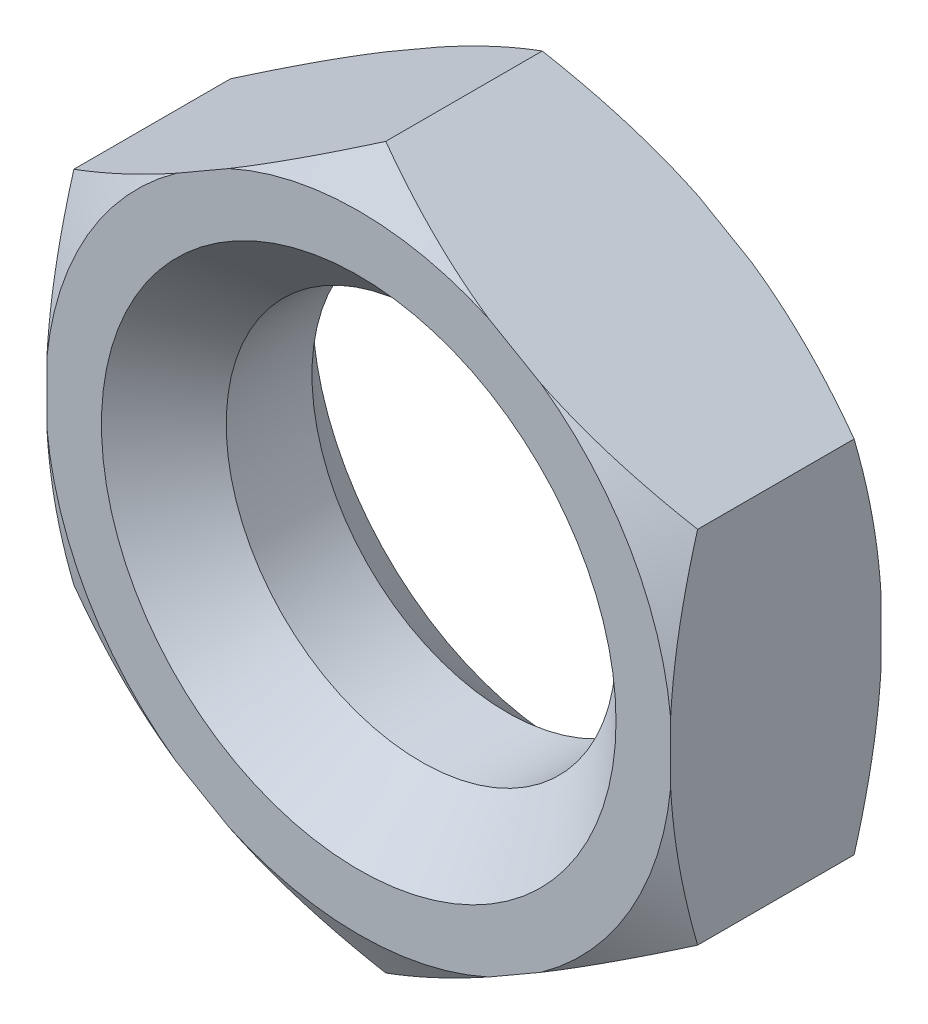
ISO-10303-21;
HEADER;
FILE_DESCRIPTION(('STEP AP214'),'2;1');
FILE_NAME('part.step','',(''),(''),'','','');
FILE_SCHEMA(('AUTOMOTIVE_DESIGN { 1 0 10303 214 1 1 1 1 }'));
ENDSEC;
DATA;
#1=APPLICATION_CONTEXT('core data for automotive mechanical design processes');
#2=APPLICATION_PROTOCOL_DEFINITION('international standard','automotive_design',2000,#1);
#3=PRODUCT_CONTEXT('',#1,'mechanical');
#4=PRODUCT('Part','Part','',(#3));
#5=PRODUCT_RELATED_PRODUCT_CATEGORY('part','',(#4));
#6=PRODUCT_DEFINITION_FORMATION('','',#4);
#7=PRODUCT_DEFINITION_CONTEXT('part definition',#1,'design');
#8=PRODUCT_DEFINITION('design','',#6,#7);
#9=PRODUCT_DEFINITION_SHAPE('','',#8);
#10=(LENGTH_UNIT() NAMED_UNIT(*) SI_UNIT(.MILLI.,.METRE.));
#11=(NAMED_UNIT(*) PLANE_ANGLE_UNIT() SI_UNIT($,.RADIAN.));
#12=(NAMED_UNIT(*) SI_UNIT($,.STERADIAN.) SOLID_ANGLE_UNIT());
#13=UNCERTAINTY_MEASURE_WITH_UNIT(LENGTH_MEASURE(1.E-05),#10,'distance_accuracy_value','');
#14=(GEOMETRIC_REPRESENTATION_CONTEXT(3) GLOBAL_UNCERTAINTY_ASSIGNED_CONTEXT((#13)) GLOBAL_UNIT_ASSIGNED_CONTEXT((#10,
#11,#12)) REPRESENTATION_CONTEXT('',''));
#15=CARTESIAN_POINT('',(0.,0.,0.));
#16=DIRECTION('',(0.,0.,1.));
#17=DIRECTION('',(1.,0.,0.));
#18=AXIS2_PLACEMENT_3D('',#15,#16,#17);
#19=CARTESIAN_POINT('',(4.,2.30940107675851,1.35));
#20=DIRECTION('',(-0.5,-0.866025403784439,0.));
#21=DIRECTION('',(0.866025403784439,-0.5,0.));
#22=AXIS2_PLACEMENT_3D('',#19,#20,#21);
#23=PLANE('',#22);
#24=CARTESIAN_POINT('',(-2.77926459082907,6.22341131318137,0.264848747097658));
#25=CARTESIAN_POINT('',(-2.65357706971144,6.15084558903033,0.197018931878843));
#26=CARTESIAN_POINT('',(-2.52758896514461,6.07810632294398,0.129920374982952));
#27=CARTESIAN_POINT('',(-2.27488483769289,5.9322075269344,-0.00247084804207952));
#28=CARTESIAN_POINT('',(-2.14816872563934,5.85904794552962,-0.0677632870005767));
#29=CARTESIAN_POINT('',(-1.8935057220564,5.71201819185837,-0.196387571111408));
#30=CARTESIAN_POINT('',(-1.76555618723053,5.63814649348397,-0.259712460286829));
#31=CARTESIAN_POINT('',(-1.50869902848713,5.48984994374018,-0.383710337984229));
#32=CARTESIAN_POINT('',(-1.37979143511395,5.41542511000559,-0.444383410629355));
#33=CARTESIAN_POINT('',(-1.11756014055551,5.26402580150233,-0.564004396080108));
#34=CARTESIAN_POINT('',(-0.984207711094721,5.18703474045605,-0.62286873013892));
#35=CARTESIAN_POINT('',(-0.716172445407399,5.03228450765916,-0.736401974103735));
#36=CARTESIAN_POINT('',(-0.581489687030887,4.95452538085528,-0.791071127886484));
#37=CARTESIAN_POINT('',(-0.310740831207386,4.7982084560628,-0.895184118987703));
#38=CARTESIAN_POINT('',(-0.174676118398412,4.71965145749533,-0.944632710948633));
#39=CARTESIAN_POINT('',(0.0990507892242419,4.56161515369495,-1.03716064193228));
#40=CARTESIAN_POINT('',(0.236712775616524,4.48213596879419,-1.08024080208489));
#41=CARTESIAN_POINT('',(0.565905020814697,4.29207673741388,-1.17342391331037));
#42=CARTESIAN_POINT('',(0.75820197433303,4.18105403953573,-1.22006382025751));
#43=CARTESIAN_POINT('',(1.04862116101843,4.01338044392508,-1.2761412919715));
#44=CARTESIAN_POINT('',(1.14575487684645,3.95730026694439,-1.29251989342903));
#45=CARTESIAN_POINT('',(1.34055583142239,3.84483188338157,-1.32023794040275));
#46=CARTESIAN_POINT('',(1.43822299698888,3.78844371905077,-1.33157806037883));
#47=CARTESIAN_POINT('',(1.63278397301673,3.67611388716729,-1.34879538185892));
#48=CARTESIAN_POINT('',(1.72967367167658,3.62017459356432,-1.35473421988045));
#49=CARTESIAN_POINT('',(1.92358891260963,3.50821757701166,-1.36119583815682));
#50=CARTESIAN_POINT('',(2.02061445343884,3.45219985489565,-1.36171867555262));
#51=CARTESIAN_POINT('',(2.21457236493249,3.34021820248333,-1.35733170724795));
#52=CARTESIAN_POINT('',(2.31150473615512,3.28425427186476,-1.35242193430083));
#53=CARTESIAN_POINT('',(2.50507013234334,3.17249923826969,-1.33731840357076));
#54=CARTESIAN_POINT('',(2.60170310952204,3.11670816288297,-1.32712384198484));
#55=CARTESIAN_POINT('',(2.82988827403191,2.98496539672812,-1.29706969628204));
#56=CARTESIAN_POINT('',(2.96122728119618,2.90913678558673,-1.27503535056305));
#57=CARTESIAN_POINT('',(3.22265075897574,2.75820387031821,-1.22264454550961));
#58=CARTESIAN_POINT('',(3.35273504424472,2.68309967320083,-1.19228687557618));
#59=CARTESIAN_POINT('',(3.61163204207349,2.533625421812,-1.12439527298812));
#60=CARTESIAN_POINT('',(3.74044314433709,2.4592562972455,-1.0868532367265));
#61=CARTESIAN_POINT('',(3.99662043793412,2.31135226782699,-1.00577578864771));
#62=CARTESIAN_POINT('',(4.12398672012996,2.23781731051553,-0.962240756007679));
#63=CARTESIAN_POINT('',(4.37887345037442,2.09065838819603,-0.86966290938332));
#64=CARTESIAN_POINT('',(4.50637754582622,2.01704386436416,-0.820560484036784));
#65=CARTESIAN_POINT('',(4.76003482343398,1.87059476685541,-0.718224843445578));
#66=CARTESIAN_POINT('',(4.88618883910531,1.79775971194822,-0.664994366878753));
#67=CARTESIAN_POINT('',(5.13734672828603,1.65275363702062,-0.555134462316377));
#68=CARTESIAN_POINT('',(5.26235083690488,1.58058248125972,-0.4985057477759));
#69=CARTESIAN_POINT('',(5.51137836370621,1.43680637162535,-0.382443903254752));
#70=CARTESIAN_POINT('',(5.63540176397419,1.36520142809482,-0.32301072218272));
#71=CARTESIAN_POINT('',(5.84520240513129,1.24407297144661,-0.220156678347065));
#72=CARTESIAN_POINT('',(5.93119941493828,1.19442257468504,-0.177331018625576));
#73=CARTESIAN_POINT('',(6.10281451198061,1.09534055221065,-0.0906881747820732));
#74=CARTESIAN_POINT('',(6.1884326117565,1.04590891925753,-0.0468710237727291));
#75=CARTESIAN_POINT('',(6.35842282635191,0.947765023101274,0.0411680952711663));
#76=CARTESIAN_POINT('',(6.44279852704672,0.899050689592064,0.0853808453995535));
#77=CARTESIAN_POINT('',(6.61124951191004,0.801795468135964,0.174567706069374));
#78=CARTESIAN_POINT('',(6.6953247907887,0.753254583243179,0.219541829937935));
#79=CARTESIAN_POINT('',(6.77926459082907,0.704791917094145,0.264848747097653));
#80=B_SPLINE_CURVE_WITH_KNOTS('',3,(#24,#25,#26,#27,#28,#29,#30,#31,#32,#33,#34,#35,#36,#37,#38,
#39,#40,#41,#42,#43,#44,#45,#46,#47,#48,#49,#50,#51,#52,#53,#54,#55,#56,#57,#58,#59,#60,#61,#62,
#63,#64,#65,#66,#67,#68,#69,#70,#71,#72,#73,#74,#75,#76,#77,#78,#79),.UNSPECIFIED.,.F.,.F.,(4,2,
2,2,2,2,2,2,2,2,2,2,2,2,2,2,2,2,2,2,2,2,2,2,2,2,2,4),(0.,0.480604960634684,0.961270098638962,
1.44347608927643,1.92566677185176,2.42016676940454,2.91463799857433,3.4086549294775,
3.90260810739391,4.58254272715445,4.92249867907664,5.26240911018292,5.59839013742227,
5.93436761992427,6.27034307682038,6.60636964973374,7.06584039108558,7.52537799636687,
7.98543702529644,8.44546695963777,8.91099531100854,9.37621741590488,9.84134218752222,
10.3064754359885,10.6308960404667,10.9553058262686,11.2762760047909,11.5972518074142),.UNSPECIFIED.);
#81=CARTESIAN_POINT('',(0.,4.61880215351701,-1.00358983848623));
#82=VERTEX_POINT('',#81);
#83=CARTESIAN_POINT('',(1.66372918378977,3.65824766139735,-1.35));
#84=VERTEX_POINT('',#83);
#85=EDGE_CURVE('E177',#82,#84,#80,.T.);
#86=ORIENTED_EDGE('',*,*,#85,.F.);
#87=DIRECTION('',(0.,0.,-1.));
#88=VECTOR('',#87,1.);
#89=CARTESIAN_POINT('',(0.,4.61880215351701,1.35));
#90=LINE('',#89,#88);
#91=CARTESIAN_POINT('',(0.,4.61880215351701,1.00358983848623));
#92=VERTEX_POINT('',#91);
#93=EDGE_CURVE('E222',#92,#82,#90,.T.);
#94=ORIENTED_EDGE('',*,*,#93,.F.);
#95=CARTESIAN_POINT('',(6.77926459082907,0.704791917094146,-0.264848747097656));
#96=CARTESIAN_POINT('',(6.65357706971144,0.777357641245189,-0.197018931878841));
#97=CARTESIAN_POINT('',(6.52758896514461,0.850096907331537,-0.12992037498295));
#98=CARTESIAN_POINT('',(6.27488483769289,0.995995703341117,0.00247084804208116));
#99=CARTESIAN_POINT('',(6.14816872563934,1.0691552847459,0.0677632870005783));
#100=CARTESIAN_POINT('',(5.8935057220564,1.21618503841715,0.19638757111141));
#101=CARTESIAN_POINT('',(5.76555618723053,1.29005673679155,0.259712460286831));
#102=CARTESIAN_POINT('',(5.50869902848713,1.43835328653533,0.383710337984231));
#103=CARTESIAN_POINT('',(5.37979143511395,1.51277812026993,0.444383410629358));
#104=CARTESIAN_POINT('',(5.11756014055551,1.66417742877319,0.56400439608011));
#105=CARTESIAN_POINT('',(4.98420771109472,1.74116848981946,0.622868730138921));
#106=CARTESIAN_POINT('',(4.7161724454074,1.89591872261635,0.736401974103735));
#107=CARTESIAN_POINT('',(4.58148968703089,1.97367784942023,0.791071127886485));
#108=CARTESIAN_POINT('',(4.31074083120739,2.12999477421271,0.895184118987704));
#109=CARTESIAN_POINT('',(4.17467611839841,2.20855177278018,0.944632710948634));
#110=CARTESIAN_POINT('',(3.90094921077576,2.36658807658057,1.03716064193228));
#111=CARTESIAN_POINT('',(3.76328722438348,2.44606726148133,1.08024080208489));
#112=CARTESIAN_POINT('',(3.4340949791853,2.63612649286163,1.17342391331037));
#113=CARTESIAN_POINT('',(3.24179802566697,2.74714919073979,1.22006382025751));
#114=CARTESIAN_POINT('',(2.95137883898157,2.91482278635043,1.2761412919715));
#115=CARTESIAN_POINT('',(2.85424512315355,2.97090296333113,1.29251989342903));
#116=CARTESIAN_POINT('',(2.65944416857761,3.08337134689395,1.32023794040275));
#117=CARTESIAN_POINT('',(2.56177700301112,3.13975951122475,1.33157806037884));
#118=CARTESIAN_POINT('',(2.36721602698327,3.25208934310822,1.34879538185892));
#119=CARTESIAN_POINT('',(2.27032632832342,3.30802863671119,1.35473421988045));
#120=CARTESIAN_POINT('',(2.07641108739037,3.41998565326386,1.36119583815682));
#121=CARTESIAN_POINT('',(1.97938554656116,3.47600337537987,1.36171867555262));
#122=CARTESIAN_POINT('',(1.78542763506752,3.58798502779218,1.35733170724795));
#123=CARTESIAN_POINT('',(1.68849526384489,3.64394895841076,1.35242193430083));
#124=CARTESIAN_POINT('',(1.49492986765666,3.75570399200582,1.33731840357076));
#125=CARTESIAN_POINT('',(1.39829689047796,3.81149506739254,1.32712384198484));
#126=CARTESIAN_POINT('',(1.17011172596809,3.94323783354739,1.29706969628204));
#127=CARTESIAN_POINT('',(1.03877271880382,4.01906644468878,1.27503535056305));
#128=CARTESIAN_POINT('',(0.777349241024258,4.1699993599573,1.22264454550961));
#129=CARTESIAN_POINT('',(0.647264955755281,4.24510355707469,1.19228687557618));
#130=CARTESIAN_POINT('',(0.388367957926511,4.39457780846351,1.12439527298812));
#131=CARTESIAN_POINT('',(0.259556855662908,4.46894693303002,1.0868532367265));
#132=CARTESIAN_POINT('',(0.00337956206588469,4.61685096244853,1.00577578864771));
#133=CARTESIAN_POINT('',(-0.123986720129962,4.69038591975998,0.962240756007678));
#134=CARTESIAN_POINT('',(-0.378873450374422,4.83754484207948,0.869662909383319));
#135=CARTESIAN_POINT('',(-0.506377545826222,4.91115936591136,0.820560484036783));
#136=CARTESIAN_POINT('',(-0.760034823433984,5.05760846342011,0.718224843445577));
#137=CARTESIAN_POINT('',(-0.886188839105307,5.1304435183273,0.664994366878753));
#138=CARTESIAN_POINT('',(-1.13734672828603,5.27544959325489,0.555134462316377));
#139=CARTESIAN_POINT('',(-1.26235083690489,5.34762074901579,0.498505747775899));
#140=CARTESIAN_POINT('',(-1.51137836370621,5.49139685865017,0.38244390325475));
#141=CARTESIAN_POINT('',(-1.63540176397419,5.5630018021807,0.323010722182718));
#142=CARTESIAN_POINT('',(-1.84520240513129,5.6841302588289,0.220156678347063));
#143=CARTESIAN_POINT('',(-1.93119941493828,5.73378065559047,0.177331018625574));
#144=CARTESIAN_POINT('',(-2.10281451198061,5.83286267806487,0.0906881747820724));
#145=CARTESIAN_POINT('',(-2.1884326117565,5.88229431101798,0.0468710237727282));
#146=CARTESIAN_POINT('',(-2.35842282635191,5.98043820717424,-0.0411680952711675));
#147=CARTESIAN_POINT('',(-2.44279852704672,6.02915254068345,-0.085380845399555));
#148=CARTESIAN_POINT('',(-2.61124951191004,6.12640776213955,-0.174567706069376));
#149=CARTESIAN_POINT('',(-2.6953247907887,6.17494864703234,-0.219541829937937));
#150=CARTESIAN_POINT('',(-2.77926459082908,6.22341131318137,-0.264848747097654));
#151=B_SPLINE_CURVE_WITH_KNOTS('',3,(#95,#96,#97,#98,#99,#100,#101,#102,#103,#104,#105,#106,
#107,#108,#109,#110,#111,#112,#113,#114,#115,#116,#117,#118,#119,#120,#121,#122,#123,#124,#125,
#126,#127,#128,#129,#130,#131,#132,#133,#134,#135,#136,#137,#138,#139,#140,#141,#142,#143,#144,
#145,#146,#147,#148,#149,#150),.UNSPECIFIED.,.F.,.F.,(4,2,2,2,2,2,2,2,2,2,2,2,2,2,2,2,2,2,2,2,2,
2,2,2,2,2,2,4),(0.,0.480604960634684,0.961270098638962,1.44347608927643,1.92566677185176,
2.42016676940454,2.91463799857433,3.4086549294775,3.90260810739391,4.58254272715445,
4.92249867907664,5.26240911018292,5.59839013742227,5.93436761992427,6.27034307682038,
6.60636964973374,7.06584039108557,7.52537799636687,7.98543702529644,8.44546695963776,
8.91099531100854,9.37621741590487,9.84134218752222,10.3064754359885,10.6308960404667,
10.9553058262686,11.2762760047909,11.5972518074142),.UNSPECIFIED.);
#152=CARTESIAN_POINT('',(1.66372918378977,3.65824766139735,1.35));
#153=VERTEX_POINT('',#152);
#154=EDGE_CURVE('E372',#153,#92,#151,.T.);
#155=ORIENTED_EDGE('',*,*,#154,.F.);
#156=DIRECTION('',(-0.866025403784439,0.5,0.));
#157=VECTOR('',#156,1.);
#158=CARTESIAN_POINT('',(4.,2.30940107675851,1.35));
#159=LINE('',#158,#157);
#160=CARTESIAN_POINT('',(2.33627081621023,3.26995556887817,1.35));
#161=VERTEX_POINT('',#160);
#162=EDGE_CURVE('E351',#161,#153,#159,.T.);
#163=ORIENTED_EDGE('',*,*,#162,.F.);
#164=CARTESIAN_POINT('',(4.,2.30940107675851,1.00358983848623));
#165=VERTEX_POINT('',#164);
#166=EDGE_CURVE('E194',#165,#161,#151,.T.);
#167=ORIENTED_EDGE('',*,*,#166,.F.);
#168=DIRECTION('',(0.,0.,-1.));
#169=VECTOR('',#168,1.);
#170=CARTESIAN_POINT('',(4.,2.30940107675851,1.35));
#171=LINE('',#170,#169);
#172=CARTESIAN_POINT('',(4.,2.30940107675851,-1.00358983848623));
#173=VERTEX_POINT('',#172);
#174=EDGE_CURVE('E183',#165,#173,#171,.T.);
#175=ORIENTED_EDGE('',*,*,#174,.T.);
#176=CARTESIAN_POINT('',(2.33627081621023,3.26995556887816,-1.35));
#177=VERTEX_POINT('',#176);
#178=EDGE_CURVE('E164',#177,#173,#80,.T.);
#179=ORIENTED_EDGE('',*,*,#178,.F.);
#180=DIRECTION('',(-0.866025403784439,0.5,0.));
#181=VECTOR('',#180,1.);
#182=CARTESIAN_POINT('',(4.,2.30940107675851,-1.35));
#183=LINE('',#182,#181);
#184=EDGE_CURVE('E264',#177,#84,#183,.T.);
#185=ORIENTED_EDGE('',*,*,#184,.T.);
#186=EDGE_LOOP('',(#86,#94,#155,#163,#167,#175,#179,#185));
#187=FACE_BOUND('',#186,.T.);
#188=ADVANCED_FACE('F39',(#187),#23,.F.);
#189=CARTESIAN_POINT('',(0.,4.61880215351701,1.35));
#190=DIRECTION('',(0.5,-0.866025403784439,0.));
#191=DIRECTION('',(0.866025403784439,0.5,0.));
#192=AXIS2_PLACEMENT_3D('',#189,#190,#191);
#193=PLANE('',#192);
#194=CARTESIAN_POINT('',(-6.77926459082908,0.704791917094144,0.264848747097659));
#195=CARTESIAN_POINT('',(-6.65357706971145,0.777357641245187,0.197018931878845));
#196=CARTESIAN_POINT('',(-6.52758896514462,0.850096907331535,0.129920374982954));
#197=CARTESIAN_POINT('',(-6.2748848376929,0.995995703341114,-0.00247084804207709));
#198=CARTESIAN_POINT('',(-6.14816872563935,1.0691552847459,-0.0677632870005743));
#199=CARTESIAN_POINT('',(-5.89350572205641,1.21618503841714,-0.196387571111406));
#200=CARTESIAN_POINT('',(-5.76555618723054,1.29005673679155,-0.259712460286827));
#201=CARTESIAN_POINT('',(-5.50869902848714,1.43835328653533,-0.383710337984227));
#202=CARTESIAN_POINT('',(-5.37979143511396,1.51277812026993,-0.444383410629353));
#203=CARTESIAN_POINT('',(-5.11756014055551,1.66417742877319,-0.564004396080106));
#204=CARTESIAN_POINT('',(-4.98420771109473,1.74116848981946,-0.622868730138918));
#205=CARTESIAN_POINT('',(-4.7161724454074,1.89591872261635,-0.736401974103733));
#206=CARTESIAN_POINT('',(-4.58148968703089,1.97367784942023,-0.791071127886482));
#207=CARTESIAN_POINT('',(-4.31074083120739,2.12999477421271,-0.895184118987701));
#208=CARTESIAN_POINT('',(-4.17467611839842,2.20855177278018,-0.944632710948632));
#209=CARTESIAN_POINT('',(-3.90094921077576,2.36658807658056,-1.03716064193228));
#210=CARTESIAN_POINT('',(-3.76328722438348,2.44606726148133,-1.08024080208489));
#211=CARTESIAN_POINT('',(-3.43409497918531,2.63612649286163,-1.17342391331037));
#212=CARTESIAN_POINT('',(-3.24179802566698,2.74714919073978,-1.22006382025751));
#213=CARTESIAN_POINT('',(-2.95137883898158,2.91482278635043,-1.2761412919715));
#214=CARTESIAN_POINT('',(-2.85424512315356,2.97090296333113,-1.29251989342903));
#215=CARTESIAN_POINT('',(-2.65944416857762,3.08337134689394,-1.32023794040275));
#216=CARTESIAN_POINT('',(-2.56177700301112,3.13975951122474,-1.33157806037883));
#217=CARTESIAN_POINT('',(-2.36721602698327,3.25208934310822,-1.34879538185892));
#218=CARTESIAN_POINT('',(-2.27032632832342,3.30802863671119,-1.35473421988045));
#219=CARTESIAN_POINT('',(-2.07641108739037,3.41998565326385,-1.36119583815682));
#220=CARTESIAN_POINT('',(-1.97938554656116,3.47600337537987,-1.36171867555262));
#221=CARTESIAN_POINT('',(-1.78542763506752,3.58798502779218,-1.35733170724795));
#222=CARTESIAN_POINT('',(-1.68849526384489,3.64394895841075,-1.35242193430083));
#223=CARTESIAN_POINT('',(-1.49492986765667,3.75570399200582,-1.33731840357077));
#224=CARTESIAN_POINT('',(-1.39829689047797,3.81149506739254,-1.32712384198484));
#225=CARTESIAN_POINT('',(-1.1701117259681,3.94323783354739,-1.29706969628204));
#226=CARTESIAN_POINT('',(-1.03877271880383,4.01906644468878,-1.27503535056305));
#227=CARTESIAN_POINT('',(-0.777349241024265,4.1699993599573,-1.22264454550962));
#228=CARTESIAN_POINT('',(-0.647264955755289,4.24510355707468,-1.19228687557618));
#229=CARTESIAN_POINT('',(-0.38836795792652,4.39457780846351,-1.12439527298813));
#230=CARTESIAN_POINT('',(-0.259556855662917,4.46894693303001,-1.08685323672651));
#231=CARTESIAN_POINT('',(-0.00337956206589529,4.61685096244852,-1.00577578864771));
#232=CARTESIAN_POINT('',(0.123986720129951,4.69038591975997,-0.962240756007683));
#233=CARTESIAN_POINT('',(0.37887345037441,4.83754484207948,-0.869662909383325));
#234=CARTESIAN_POINT('',(0.506377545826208,4.91115936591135,-0.820560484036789));
#235=CARTESIAN_POINT('',(0.76003482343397,5.0576084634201,-0.718224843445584));
#236=CARTESIAN_POINT('',(0.886188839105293,5.13044351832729,-0.664994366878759));
#237=CARTESIAN_POINT('',(1.13734672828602,5.27544959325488,-0.555134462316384));
#238=CARTESIAN_POINT('',(1.26235083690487,5.34762074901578,-0.498505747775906));
#239=CARTESIAN_POINT('',(1.5113783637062,5.49139685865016,-0.382443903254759));
#240=CARTESIAN_POINT('',(1.63540176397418,5.56300180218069,-0.323010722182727));
#241=CARTESIAN_POINT('',(1.84520240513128,5.68413025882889,-0.220156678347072));
#242=CARTESIAN_POINT('',(1.93119941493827,5.73378065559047,-0.177331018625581));
#243=CARTESIAN_POINT('',(2.10281451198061,5.83286267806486,-0.090688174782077));
#244=CARTESIAN_POINT('',(2.1884326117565,5.88229431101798,-0.046871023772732));
#245=CARTESIAN_POINT('',(2.35842282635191,5.98043820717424,0.0411680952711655));
#246=CARTESIAN_POINT('',(2.44279852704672,6.02915254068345,0.0853808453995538));
#247=CARTESIAN_POINT('',(2.61124951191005,6.12640776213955,0.174567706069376));
#248=CARTESIAN_POINT('',(2.69532479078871,6.17494864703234,0.219541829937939));
#249=CARTESIAN_POINT('',(2.77926459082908,6.22341131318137,0.264848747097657));
#250=B_SPLINE_CURVE_WITH_KNOTS('',3,(#194,#195,#196,#197,#198,#199,#200,#201,#202,#203,#204,
#205,#206,#207,#208,#209,#210,#211,#212,#213,#214,#215,#216,#217,#218,#219,#220,#221,#222,#223,
#224,#225,#226,#227,#228,#229,#230,#231,#232,#233,#234,#235,#236,#237,#238,#239,#240,#241,#242,
#243,#244,#245,#246,#247,#248,#249),.UNSPECIFIED.,.F.,.F.,(4,2,2,2,2,2,2,2,2,2,2,2,2,2,2,2,2,2,
2,2,2,2,2,2,2,2,2,4),(0.,0.480604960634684,0.961270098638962,1.44347608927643,1.92566677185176,
2.42016676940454,2.91463799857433,3.4086549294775,3.90260810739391,4.58254272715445,
4.92249867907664,5.26240911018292,5.59839013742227,5.93436761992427,6.27034307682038,
6.60636964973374,7.06584039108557,7.52537799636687,7.98543702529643,8.44546695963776,
8.91099531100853,9.37621741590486,9.84134218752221,10.3064754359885,10.6308960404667,
10.9553058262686,11.2762760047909,11.5972518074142),.UNSPECIFIED.);
#251=CARTESIAN_POINT('',(-4.,2.30940107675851,-1.00358983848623));
#252=VERTEX_POINT('',#251);
#253=CARTESIAN_POINT('',(-2.33627081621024,3.26995556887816,-1.35));
#254=VERTEX_POINT('',#253);
#255=EDGE_CURVE('E55',#252,#254,#250,.T.);
#256=ORIENTED_EDGE('',*,*,#255,.F.);
#257=DIRECTION('',(0.,0.,-1.));
#258=VECTOR('',#257,1.);
#259=CARTESIAN_POINT('',(-4.,2.30940107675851,1.35));
#260=LINE('',#259,#258);
#261=CARTESIAN_POINT('',(-4.,2.30940107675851,1.00358983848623));
#262=VERTEX_POINT('',#261);
#263=EDGE_CURVE('E219',#262,#252,#260,.T.);
#264=ORIENTED_EDGE('',*,*,#263,.F.);
#265=CARTESIAN_POINT('',(2.77926459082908,6.22341131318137,-0.26484874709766));
#266=CARTESIAN_POINT('',(2.65357706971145,6.15084558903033,-0.197018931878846));
#267=CARTESIAN_POINT('',(2.52758896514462,6.07810632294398,-0.129920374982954));
#268=CARTESIAN_POINT('',(2.2748848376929,5.9322075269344,0.00247084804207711));
#269=CARTESIAN_POINT('',(2.14816872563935,5.85904794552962,0.0677632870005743));
#270=CARTESIAN_POINT('',(1.89350572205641,5.71201819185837,0.196387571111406));
#271=CARTESIAN_POINT('',(1.76555618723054,5.63814649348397,0.259712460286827));
#272=CARTESIAN_POINT('',(1.50869902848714,5.48984994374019,0.383710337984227));
#273=CARTESIAN_POINT('',(1.37979143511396,5.41542511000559,0.444383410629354));
#274=CARTESIAN_POINT('',(1.11756014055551,5.26402580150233,0.564004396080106));
#275=CARTESIAN_POINT('',(0.984207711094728,5.18703474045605,0.622868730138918));
#276=CARTESIAN_POINT('',(0.716172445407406,5.03228450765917,0.736401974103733));
#277=CARTESIAN_POINT('',(0.581489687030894,4.95452538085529,0.791071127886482));
#278=CARTESIAN_POINT('',(0.310740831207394,4.7982084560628,0.895184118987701));
#279=CARTESIAN_POINT('',(0.174676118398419,4.71965145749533,0.944632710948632));
#280=CARTESIAN_POINT('',(-0.0990507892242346,4.56161515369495,1.03716064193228));
#281=CARTESIAN_POINT('',(-0.236712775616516,4.48213596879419,1.08024080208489));
#282=CARTESIAN_POINT('',(-0.56590502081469,4.29207673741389,1.17342391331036));
#283=CARTESIAN_POINT('',(-0.758201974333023,4.18105403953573,1.22006382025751));
#284=CARTESIAN_POINT('',(-1.04862116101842,4.01338044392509,1.2761412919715));
#285=CARTESIAN_POINT('',(-1.14575487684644,3.95730026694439,1.29251989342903));
#286=CARTESIAN_POINT('',(-1.34055583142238,3.84483188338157,1.32023794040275));
#287=CARTESIAN_POINT('',(-1.43822299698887,3.78844371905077,1.33157806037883));
#288=CARTESIAN_POINT('',(-1.63278397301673,3.6761138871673,1.34879538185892));
#289=CARTESIAN_POINT('',(-1.72967367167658,3.62017459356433,1.35473421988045));
#290=CARTESIAN_POINT('',(-1.92358891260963,3.50821757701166,1.36119583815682));
#291=CARTESIAN_POINT('',(-2.02061445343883,3.45219985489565,1.36171867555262));
#292=CARTESIAN_POINT('',(-2.21457236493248,3.34021820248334,1.35733170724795));
#293=CARTESIAN_POINT('',(-2.31150473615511,3.28425427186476,1.35242193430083));
#294=CARTESIAN_POINT('',(-2.50507013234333,3.1724992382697,1.33731840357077));
#295=CARTESIAN_POINT('',(-2.60170310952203,3.11670816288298,1.32712384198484));
#296=CARTESIAN_POINT('',(-2.8298882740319,2.98496539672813,1.29706969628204));
#297=CARTESIAN_POINT('',(-2.96122728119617,2.90913678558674,1.27503535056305));
#298=CARTESIAN_POINT('',(-3.22265075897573,2.75820387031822,1.22264454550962));
#299=CARTESIAN_POINT('',(-3.35273504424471,2.68309967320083,1.19228687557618));
#300=CARTESIAN_POINT('',(-3.61163204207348,2.53362542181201,1.12439527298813));
#301=CARTESIAN_POINT('',(-3.74044314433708,2.4592562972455,1.08685323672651));
#302=CARTESIAN_POINT('',(-3.99662043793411,2.311352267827,1.00577578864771));
#303=CARTESIAN_POINT('',(-4.12398672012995,2.23781731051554,0.962240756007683));
#304=CARTESIAN_POINT('',(-4.37887345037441,2.09065838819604,0.869662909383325));
#305=CARTESIAN_POINT('',(-4.50637754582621,2.01704386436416,0.820560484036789));
#306=CARTESIAN_POINT('',(-4.76003482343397,1.87059476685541,0.718224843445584));
#307=CARTESIAN_POINT('',(-4.88618883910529,1.79775971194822,0.66499436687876));
#308=CARTESIAN_POINT('',(-5.13734672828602,1.65275363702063,0.555134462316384));
#309=CARTESIAN_POINT('',(-5.26235083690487,1.58058248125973,0.498505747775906));
#310=CARTESIAN_POINT('',(-5.5113783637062,1.43680637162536,0.382443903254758));
#311=CARTESIAN_POINT('',(-5.63540176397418,1.36520142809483,0.323010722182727));
#312=CARTESIAN_POINT('',(-5.84520240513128,1.24407297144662,0.220156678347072));
#313=CARTESIAN_POINT('',(-5.93119941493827,1.19442257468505,0.177331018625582));
#314=CARTESIAN_POINT('',(-6.1028145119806,1.09534055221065,0.0906881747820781));
#315=CARTESIAN_POINT('',(-6.1884326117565,1.04590891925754,0.0468710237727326));
#316=CARTESIAN_POINT('',(-6.35842282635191,0.947765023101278,-0.0411680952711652));
#317=CARTESIAN_POINT('',(-6.44279852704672,0.899050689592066,-0.0853808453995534));
#318=CARTESIAN_POINT('',(-6.61124951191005,0.801795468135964,-0.174567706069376));
#319=CARTESIAN_POINT('',(-6.69532479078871,0.753254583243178,-0.219541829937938));
#320=CARTESIAN_POINT('',(-6.77926459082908,0.704791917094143,-0.264848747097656));
#321=B_SPLINE_CURVE_WITH_KNOTS('',3,(#265,#266,#267,#268,#269,#270,#271,#272,#273,#274,#275,
#276,#277,#278,#279,#280,#281,#282,#283,#284,#285,#286,#287,#288,#289,#290,#291,#292,#293,#294,
#295,#296,#297,#298,#299,#300,#301,#302,#303,#304,#305,#306,#307,#308,#309,#310,#311,#312,#313,
#314,#315,#316,#317,#318,#319,#320),.UNSPECIFIED.,.F.,.F.,(4,2,2,2,2,2,2,2,2,2,2,2,2,2,2,2,2,2,
2,2,2,2,2,2,2,2,2,4),(0.,0.480604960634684,0.961270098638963,1.44347608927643,1.92566677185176,
2.42016676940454,2.91463799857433,3.4086549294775,3.90260810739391,4.58254272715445,
4.92249867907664,5.26240911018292,5.59839013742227,5.93436761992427,6.27034307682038,
6.60636964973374,7.06584039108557,7.52537799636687,7.98543702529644,8.44546695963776,
8.91099531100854,9.37621741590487,9.84134218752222,10.3064754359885,10.6308960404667,
10.9553058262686,11.2762760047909,11.5972518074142),.UNSPECIFIED.);
#322=CARTESIAN_POINT('',(-2.33627081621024,3.26995556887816,1.35));
#323=VERTEX_POINT('',#322);
#324=EDGE_CURVE('E344',#323,#262,#321,.T.);
#325=ORIENTED_EDGE('',*,*,#324,.F.);
#326=DIRECTION('',(-0.866025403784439,-0.5,0.));
#327=VECTOR('',#326,1.);
#328=CARTESIAN_POINT('',(0.,4.61880215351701,1.35));
#329=LINE('',#328,#327);
#330=CARTESIAN_POINT('',(-1.66372918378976,3.65824766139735,1.35));
#331=VERTEX_POINT('',#330);
#332=EDGE_CURVE('E355',#331,#323,#329,.T.);
#333=ORIENTED_EDGE('',*,*,#332,.F.);
#334=EDGE_CURVE('E350',#92,#331,#321,.T.);
#335=ORIENTED_EDGE('',*,*,#334,.F.);
#336=ORIENTED_EDGE('',*,*,#93,.T.);
#337=CARTESIAN_POINT('',(-1.66372918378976,3.65824766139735,-1.35));
#338=VERTEX_POINT('',#337);
#339=EDGE_CURVE('E422',#338,#82,#250,.T.);
#340=ORIENTED_EDGE('',*,*,#339,.F.);
#341=DIRECTION('',(-0.866025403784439,-0.5,0.));
#342=VECTOR('',#341,1.);
#343=CARTESIAN_POINT('',(0.,4.61880215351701,-1.35));
#344=LINE('',#343,#342);
#345=EDGE_CURVE('E371',#338,#254,#344,.T.);
#346=ORIENTED_EDGE('',*,*,#345,.T.);
#347=EDGE_LOOP('',(#256,#264,#325,#333,#335,#336,#340,#346));
#348=FACE_BOUND('',#347,.T.);
#349=ADVANCED_FACE('F324',(#348),#193,.F.);
#350=CARTESIAN_POINT('',(-4.,2.30940107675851,1.35));
#351=DIRECTION('',(1.,0.,0.));
#352=DIRECTION('',(0.,0.,-1.));
#353=AXIS2_PLACEMENT_3D('',#350,#351,#352);
#354=PLANE('',#353);
#355=CARTESIAN_POINT('',(-4.,-5.08866566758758,0.0666993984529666));
#356=CARTESIAN_POINT('',(-4.,-4.94414615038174,0.00111879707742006));
#357=CARTESIAN_POINT('',(-4.,-4.79923170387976,-0.0636075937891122));
#358=CARTESIAN_POINT('',(-4.,-4.50844333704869,-0.19093771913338));
#359=CARTESIAN_POINT('',(-4.,-4.36256924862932,-0.253541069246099));
#360=CARTESIAN_POINT('',(-4.,-4.06913305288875,-0.376442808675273));
#361=CARTESIAN_POINT('',(-4.,-3.92156644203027,-0.436730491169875));
#362=CARTESIAN_POINT('',(-4.,-3.62518774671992,-0.554150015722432));
#363=CARTESIAN_POINT('',(-4.,-3.47637571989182,-0.611282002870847));
#364=CARTESIAN_POINT('',(-4.,-3.17798204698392,-0.721445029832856));
#365=CARTESIAN_POINT('',(-4.,-3.02840679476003,-0.774493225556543));
#366=CARTESIAN_POINT('',(-4.,-2.72767549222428,-0.875897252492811));
#367=CARTESIAN_POINT('',(-4.,-2.57651933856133,-0.924252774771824));
#368=CARTESIAN_POINT('',(-4.,-2.12084922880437,-1.06062944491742));
#369=CARTESIAN_POINT('',(-4.,-1.81364350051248,-1.14014850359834));
#370=CARTESIAN_POINT('',(-4.,-1.28033133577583,-1.24840613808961));
#371=CARTESIAN_POINT('',(-4.,-1.05588972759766,-1.28514774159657));
#372=CARTESIAN_POINT('',(-4.,-0.717455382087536,-1.32487260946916));
#373=CARTESIAN_POINT('',(-4.,-0.604348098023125,-1.3355496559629));
#374=CARTESIAN_POINT('',(-4.,-0.377758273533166,-1.35148677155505));
#375=CARTESIAN_POINT('',(-4.,-0.264275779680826,-1.35674748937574));
#376=CARTESIAN_POINT('',(-4.,-0.0372413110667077,-1.36168400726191));
#377=CARTESIAN_POINT('',(-4.,0.0763106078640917,-1.36136237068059));
#378=CARTESIAN_POINT('',(-4.,0.303259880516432,-1.35515259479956));
#379=CARTESIAN_POINT('',(-4.,0.416657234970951,-1.34926448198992));
#380=CARTESIAN_POINT('',(-4.,0.643045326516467,-1.33210091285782));
#381=CARTESIAN_POINT('',(-4.,0.756036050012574,-1.32082527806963));
#382=CARTESIAN_POINT('',(-4.,0.981405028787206,-1.29321260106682));
#383=CARTESIAN_POINT('',(-4.,1.09378317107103,-1.27687465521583));
#384=CARTESIAN_POINT('',(-4.,1.54188975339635,-1.20219605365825));
#385=CARTESIAN_POINT('',(-4.,1.87460189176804,-1.12522286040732));
#386=CARTESIAN_POINT('',(-4.,2.36751874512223,-0.987952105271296));
#387=CARTESIAN_POINT('',(-4.,2.53101356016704,-0.938479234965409));
#388=CARTESIAN_POINT('',(-4.,2.85611626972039,-0.833635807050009));
#389=CARTESIAN_POINT('',(-4.,3.01772429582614,-0.778265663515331));
#390=CARTESIAN_POINT('',(-4.,3.3410660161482,-0.662128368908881));
#391=CARTESIAN_POINT('',(-4.,3.50277978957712,-0.601306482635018));
#392=CARTESIAN_POINT('',(-4.,3.82469686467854,-0.475769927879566));
#393=CARTESIAN_POINT('',(-4.,3.98490007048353,-0.411055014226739));
#394=CARTESIAN_POINT('',(-4.,4.30300593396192,-0.278909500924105));
#395=CARTESIAN_POINT('',(-4.,4.46091670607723,-0.211498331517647));
#396=CARTESIAN_POINT('',(-4.,4.7755935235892,-0.0741553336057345));
#397=CARTESIAN_POINT('',(-4.,4.93235984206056,-0.00422413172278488));
#398=CARTESIAN_POINT('',(-4.,5.08866566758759,0.0666993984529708));
#399=B_SPLINE_CURVE_WITH_KNOTS('',3,(#355,#356,#357,#358,#359,#360,#361,#362,#363,#364,#365,
#366,#367,#368,#369,#370,#371,#372,#373,#374,#375,#376,#377,#378,#379,#380,#381,#382,#383,#384,
#385,#386,#387,#388,#389,#390,#391,#392,#393,#394,#395,#396,#397,#398),.UNSPECIFIED.,.F.,.F.,(4,
2,2,2,2,2,2,2,2,2,2,2,2,2,2,2,2,2,2,2,2,4),(0.,0.476116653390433,0.952319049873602,
1.43050831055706,1.90867556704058,2.38470991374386,2.8607755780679,3.81133518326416,
4.4927622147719,4.83347879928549,5.17415457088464,5.51467391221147,5.85519163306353,
6.19572063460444,6.53631045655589,7.5583874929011,8.07079781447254,8.58317218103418,
9.1014378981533,9.61973628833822,10.1348057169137,10.6497479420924),.UNSPECIFIED.);
#400=CARTESIAN_POINT('',(-4.00000000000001,-2.3094010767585,-1.00358983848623));
#401=VERTEX_POINT('',#400);
#402=CARTESIAN_POINT('',(-4.,-0.388292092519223,-1.35));
#403=VERTEX_POINT('',#402);
#404=EDGE_CURVE('E63',#401,#403,#399,.T.);
#405=ORIENTED_EDGE('',*,*,#404,.F.);
#406=DIRECTION('',(0.,0.,-1.));
#407=VECTOR('',#406,1.);
#408=CARTESIAN_POINT('',(-4.,-2.3094010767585,1.35));
#409=LINE('',#408,#407);
#410=CARTESIAN_POINT('',(-4.00000000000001,-2.3094010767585,1.00358983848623));
#411=VERTEX_POINT('',#410);
#412=EDGE_CURVE('E215',#411,#401,#409,.T.);
#413=ORIENTED_EDGE('',*,*,#412,.F.);
#414=CARTESIAN_POINT('',(-4.,5.08866566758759,-0.0666993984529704));
#415=CARTESIAN_POINT('',(-4.,4.94414615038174,-0.00111879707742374));
#416=CARTESIAN_POINT('',(-4.,4.79923170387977,0.0636075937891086));
#417=CARTESIAN_POINT('',(-4.,4.5084433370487,0.190937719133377));
#418=CARTESIAN_POINT('',(-4.,4.36256924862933,0.253541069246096));
#419=CARTESIAN_POINT('',(-4.,4.06913305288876,0.37644280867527));
#420=CARTESIAN_POINT('',(-4.,3.92156644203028,0.436730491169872));
#421=CARTESIAN_POINT('',(-4.,3.62518774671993,0.554150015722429));
#422=CARTESIAN_POINT('',(-4.,3.47637571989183,0.611282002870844));
#423=CARTESIAN_POINT('',(-4.,3.17798204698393,0.721445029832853));
#424=CARTESIAN_POINT('',(-4.,3.02840679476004,0.77449322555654));
#425=CARTESIAN_POINT('',(-4.,2.72767549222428,0.875897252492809));
#426=CARTESIAN_POINT('',(-4.,2.57651933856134,0.924252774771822));
#427=CARTESIAN_POINT('',(-4.,2.12084922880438,1.06062944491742));
#428=CARTESIAN_POINT('',(-4.,1.81364350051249,1.14014850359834));
#429=CARTESIAN_POINT('',(-4.,1.28033133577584,1.24840613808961));
#430=CARTESIAN_POINT('',(-4.,1.05588972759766,1.28514774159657));
#431=CARTESIAN_POINT('',(-4.,0.717455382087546,1.32487260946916));
#432=CARTESIAN_POINT('',(-4.,0.604348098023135,1.33554965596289));
#433=CARTESIAN_POINT('',(-4.,0.377758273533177,1.35148677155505));
#434=CARTESIAN_POINT('',(-4.,0.264275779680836,1.35674748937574));
#435=CARTESIAN_POINT('',(-4.,0.0372413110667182,1.36168400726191));
#436=CARTESIAN_POINT('',(-4.,-0.0763106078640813,1.36136237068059));
#437=CARTESIAN_POINT('',(-4.,-0.303259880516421,1.35515259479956));
#438=CARTESIAN_POINT('',(-4.,-0.41665723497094,1.34926448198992));
#439=CARTESIAN_POINT('',(-4.,-0.643045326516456,1.33210091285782));
#440=CARTESIAN_POINT('',(-4.,-0.756036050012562,1.32082527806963));
#441=CARTESIAN_POINT('',(-4.,-0.981405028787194,1.29321260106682));
#442=CARTESIAN_POINT('',(-4.,-1.09378317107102,1.27687465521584));
#443=CARTESIAN_POINT('',(-4.,-1.54188975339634,1.20219605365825));
#444=CARTESIAN_POINT('',(-4.,-1.87460189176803,1.12522286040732));
#445=CARTESIAN_POINT('',(-4.,-2.36751874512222,0.987952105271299));
#446=CARTESIAN_POINT('',(-4.,-2.53101356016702,0.938479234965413));
#447=CARTESIAN_POINT('',(-4.,-2.85611626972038,0.833635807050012));
#448=CARTESIAN_POINT('',(-4.,-3.01772429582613,0.778265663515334));
#449=CARTESIAN_POINT('',(-4.,-3.34106601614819,0.662128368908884));
#450=CARTESIAN_POINT('',(-4.,-3.50277978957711,0.601306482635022));
#451=CARTESIAN_POINT('',(-4.,-3.82469686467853,0.475769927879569));
#452=CARTESIAN_POINT('',(-4.,-3.98490007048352,0.411055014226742));
#453=CARTESIAN_POINT('',(-4.,-4.30300593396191,0.278909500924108));
#454=CARTESIAN_POINT('',(-4.,-4.46091670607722,0.21149833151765));
#455=CARTESIAN_POINT('',(-4.,-4.7755935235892,0.0741553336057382));
#456=CARTESIAN_POINT('',(-4.,-4.93235984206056,0.00422413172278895));
#457=CARTESIAN_POINT('',(-4.,-5.08866566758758,-0.0666993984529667));
#458=B_SPLINE_CURVE_WITH_KNOTS('',3,(#414,#415,#416,#417,#418,#419,#420,#421,#422,#423,#424,
#425,#426,#427,#428,#429,#430,#431,#432,#433,#434,#435,#436,#437,#438,#439,#440,#441,#442,#443,
#444,#445,#446,#447,#448,#449,#450,#451,#452,#453,#454,#455,#456,#457),.UNSPECIFIED.,.F.,.F.,(4,
2,2,2,2,2,2,2,2,2,2,2,2,2,2,2,2,2,2,2,2,4),(0.,0.476116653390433,0.952319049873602,
1.43050831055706,1.90867556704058,2.38470991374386,2.8607755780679,3.81133518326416,
4.4927622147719,4.83347879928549,5.17415457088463,5.51467391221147,5.85519163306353,
6.19572063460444,6.53631045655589,7.5583874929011,8.07079781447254,8.58317218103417,
9.1014378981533,9.61973628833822,10.1348057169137,10.6497479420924),.UNSPECIFIED.);
#459=CARTESIAN_POINT('',(-4.,-0.388292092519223,1.35));
#460=VERTEX_POINT('',#459);
#461=EDGE_CURVE('E330',#460,#411,#458,.T.);
#462=ORIENTED_EDGE('',*,*,#461,.F.);
#463=DIRECTION('',(0.,-1.,0.));
#464=VECTOR('',#463,1.);
#465=CARTESIAN_POINT('',(-4.,2.30940107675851,1.35));
#466=LINE('',#465,#464);
#467=CARTESIAN_POINT('',(-4.,0.388292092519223,1.35));
#468=VERTEX_POINT('',#467);
#469=EDGE_CURVE('E359',#468,#460,#466,.T.);
#470=ORIENTED_EDGE('',*,*,#469,.F.);
#471=EDGE_CURVE('E337',#262,#468,#458,.T.);
#472=ORIENTED_EDGE('',*,*,#471,.F.);
#473=ORIENTED_EDGE('',*,*,#263,.T.);
#474=CARTESIAN_POINT('',(-4.,0.388292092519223,-1.35));
#475=VERTEX_POINT('',#474);
#476=EDGE_CURVE('E313',#475,#252,#399,.T.);
#477=ORIENTED_EDGE('',*,*,#476,.F.);
#478=DIRECTION('',(0.,-1.,0.));
#479=VECTOR('',#478,1.);
#480=CARTESIAN_POINT('',(-4.,2.30940107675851,-1.35));
#481=LINE('',#480,#479);
#482=EDGE_CURVE('E376',#475,#403,#481,.T.);
#483=ORIENTED_EDGE('',*,*,#482,.T.);
#484=EDGE_LOOP('',(#405,#413,#462,#470,#472,#473,#477,#483));
#485=FACE_BOUND('',#484,.T.);
#486=ADVANCED_FACE('F320',(#485),#354,.F.);
#487=CARTESIAN_POINT('',(-4.,-2.3094010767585,1.35));
#488=DIRECTION('',(0.5,0.866025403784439,0.));
#489=DIRECTION('',(-0.866025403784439,0.5,0.));
#490=AXIS2_PLACEMENT_3D('',#487,#488,#489);
#491=PLANE('',#490);
#492=CARTESIAN_POINT('',(2.77926459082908,-6.22341131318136,0.264848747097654));
#493=CARTESIAN_POINT('',(2.65357706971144,-6.15084558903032,0.197018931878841));
#494=CARTESIAN_POINT('',(2.52758896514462,-6.07810632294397,0.129920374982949));
#495=CARTESIAN_POINT('',(2.2748848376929,-5.93220752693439,-0.00247084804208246));
#496=CARTESIAN_POINT('',(2.14816872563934,-5.85904794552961,-0.06776328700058));
#497=CARTESIAN_POINT('',(1.8935057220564,-5.71201819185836,-0.196387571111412));
#498=CARTESIAN_POINT('',(1.76555618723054,-5.63814649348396,-0.259712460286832));
#499=CARTESIAN_POINT('',(1.50869902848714,-5.48984994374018,-0.383710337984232));
#500=CARTESIAN_POINT('',(1.37979143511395,-5.41542511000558,-0.444383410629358));
#501=CARTESIAN_POINT('',(1.11756014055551,-5.26402580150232,-0.56400439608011));
#502=CARTESIAN_POINT('',(0.984207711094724,-5.18703474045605,-0.622868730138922));
#503=CARTESIAN_POINT('',(0.716172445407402,-5.03228450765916,-0.736401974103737));
#504=CARTESIAN_POINT('',(0.581489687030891,-4.95452538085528,-0.791071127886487));
#505=CARTESIAN_POINT('',(0.310740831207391,-4.7982084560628,-0.895184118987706));
#506=CARTESIAN_POINT('',(0.174676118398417,-4.71965145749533,-0.944632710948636));
#507=CARTESIAN_POINT('',(-0.0990507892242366,-4.56161515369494,-1.03716064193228));
#508=CARTESIAN_POINT('',(-0.236712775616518,-4.48213596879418,-1.08024080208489));
#509=CARTESIAN_POINT('',(-0.565905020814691,-4.29207673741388,-1.17342391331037));
#510=CARTESIAN_POINT('',(-0.758201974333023,-4.18105403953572,-1.22006382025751));
#511=CARTESIAN_POINT('',(-1.04862116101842,-4.01338044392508,-1.2761412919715));
#512=CARTESIAN_POINT('',(-1.14575487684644,-3.95730026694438,-1.29251989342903));
#513=CARTESIAN_POINT('',(-1.34055583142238,-3.84483188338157,-1.32023794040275));
#514=CARTESIAN_POINT('',(-1.43822299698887,-3.78844371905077,-1.33157806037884));
#515=CARTESIAN_POINT('',(-1.63278397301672,-3.67611388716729,-1.34879538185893));
#516=CARTESIAN_POINT('',(-1.72967367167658,-3.62017459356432,-1.35473421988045));
#517=CARTESIAN_POINT('',(-1.92358891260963,-3.50821757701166,-1.36119583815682));
#518=CARTESIAN_POINT('',(-2.02061445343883,-3.45219985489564,-1.36171867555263));
#519=CARTESIAN_POINT('',(-2.21457236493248,-3.34021820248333,-1.35733170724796));
#520=CARTESIAN_POINT('',(-2.31150473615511,-3.28425427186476,-1.35242193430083));
#521=CARTESIAN_POINT('',(-2.50507013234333,-3.17249923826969,-1.33731840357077));
#522=CARTESIAN_POINT('',(-2.60170310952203,-3.11670816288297,-1.32712384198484));
#523=CARTESIAN_POINT('',(-2.8298882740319,-2.98496539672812,-1.29706969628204));
#524=CARTESIAN_POINT('',(-2.96122728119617,-2.90913678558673,-1.27503535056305));
#525=CARTESIAN_POINT('',(-3.22265075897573,-2.75820387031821,-1.22264454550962));
#526=CARTESIAN_POINT('',(-3.35273504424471,-2.68309967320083,-1.19228687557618));
#527=CARTESIAN_POINT('',(-3.61163204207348,-2.533625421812,-1.12439527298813));
#528=CARTESIAN_POINT('',(-3.74044314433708,-2.4592562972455,-1.08685323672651));
#529=CARTESIAN_POINT('',(-3.9966204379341,-2.31135226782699,-1.00577578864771));
#530=CARTESIAN_POINT('',(-4.12398672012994,-2.23781731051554,-0.962240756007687));
#531=CARTESIAN_POINT('',(-4.3788734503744,-2.09065838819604,-0.869662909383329));
#532=CARTESIAN_POINT('',(-4.5063775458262,-2.01704386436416,-0.820560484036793));
#533=CARTESIAN_POINT('',(-4.76003482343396,-1.87059476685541,-0.718224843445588));
#534=CARTESIAN_POINT('',(-4.88618883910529,-1.79775971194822,-0.664994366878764));
#535=CARTESIAN_POINT('',(-5.13734672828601,-1.65275363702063,-0.555134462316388));
#536=CARTESIAN_POINT('',(-5.26235083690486,-1.58058248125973,-0.498505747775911));
#537=CARTESIAN_POINT('',(-5.51137836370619,-1.43680637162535,-0.382443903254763));
#538=CARTESIAN_POINT('',(-5.63540176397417,-1.36520142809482,-0.323010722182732));
#539=CARTESIAN_POINT('',(-5.84520240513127,-1.24407297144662,-0.220156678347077));
#540=CARTESIAN_POINT('',(-5.93119941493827,-1.19442257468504,-0.177331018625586));
#541=CARTESIAN_POINT('',(-6.1028145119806,-1.09534055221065,-0.0906881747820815));
#542=CARTESIAN_POINT('',(-6.18843261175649,-1.04590891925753,-0.046871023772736));
#543=CARTESIAN_POINT('',(-6.3584228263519,-0.947765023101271,0.0411680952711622));
#544=CARTESIAN_POINT('',(-6.44279852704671,-0.899050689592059,0.0853808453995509));
#545=CARTESIAN_POINT('',(-6.61124951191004,-0.801795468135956,0.174567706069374));
#546=CARTESIAN_POINT('',(-6.6953247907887,-0.753254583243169,0.219541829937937));
#547=CARTESIAN_POINT('',(-6.77926459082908,-0.704791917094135,0.264848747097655));
#548=B_SPLINE_CURVE_WITH_KNOTS('',3,(#492,#493,#494,#495,#496,#497,#498,#499,#500,#501,#502,
#503,#504,#505,#506,#507,#508,#509,#510,#511,#512,#513,#514,#515,#516,#517,#518,#519,#520,#521,
#522,#523,#524,#525,#526,#527,#528,#529,#530,#531,#532,#533,#534,#535,#536,#537,#538,#539,#540,
#541,#542,#543,#544,#545,#546,#547),.UNSPECIFIED.,.F.,.F.,(4,2,2,2,2,2,2,2,2,2,2,2,2,2,2,2,2,2,
2,2,2,2,2,2,2,2,2,4),(0.,0.480604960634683,0.961270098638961,1.44347608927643,1.92566677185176,
2.42016676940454,2.91463799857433,3.4086549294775,3.9026081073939,4.58254272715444,
4.92249867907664,5.26240911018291,5.59839013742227,5.93436761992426,6.27034307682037,
6.60636964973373,7.06584039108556,7.52537799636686,7.98543702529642,8.44546695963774,
8.91099531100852,9.37621741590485,9.8413421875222,10.3064754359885,10.6308960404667,
10.9553058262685,11.2762760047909,11.5972518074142),.UNSPECIFIED.);
#549=CARTESIAN_POINT('',(0.,-4.61880215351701,-1.00358983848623));
#550=VERTEX_POINT('',#549);
#551=CARTESIAN_POINT('',(-1.6637291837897,-3.65824766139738,-1.35));
#552=VERTEX_POINT('',#551);
#553=EDGE_CURVE('E302',#550,#552,#548,.T.);
#554=ORIENTED_EDGE('',*,*,#553,.F.);
#555=DIRECTION('',(0.,0.,-1.));
#556=VECTOR('',#555,1.);
#557=CARTESIAN_POINT('',(0.,-4.618802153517,1.35));
#558=LINE('',#557,#556);
#559=CARTESIAN_POINT('',(0.,-4.61880215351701,1.00358983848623));
#560=VERTEX_POINT('',#559);
#561=EDGE_CURVE('E203',#560,#550,#558,.T.);
#562=ORIENTED_EDGE('',*,*,#561,.F.);
#563=CARTESIAN_POINT('',(-6.77926459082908,-0.704791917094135,-0.264848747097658));
#564=CARTESIAN_POINT('',(-6.65357706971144,-0.777357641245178,-0.197018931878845));
#565=CARTESIAN_POINT('',(-6.52758896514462,-0.850096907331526,-0.129920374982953));
#566=CARTESIAN_POINT('',(-6.2748848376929,-0.995995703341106,0.00247084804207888));
#567=CARTESIAN_POINT('',(-6.14816872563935,-1.06915528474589,0.0677632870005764));
#568=CARTESIAN_POINT('',(-5.89350572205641,-1.21618503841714,0.196387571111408));
#569=CARTESIAN_POINT('',(-5.76555618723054,-1.29005673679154,0.259712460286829));
#570=CARTESIAN_POINT('',(-5.50869902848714,-1.43835328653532,0.383710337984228));
#571=CARTESIAN_POINT('',(-5.37979143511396,-1.51277812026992,0.444383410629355));
#572=CARTESIAN_POINT('',(-5.11756014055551,-1.66417742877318,0.564004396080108));
#573=CARTESIAN_POINT('',(-4.98420771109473,-1.74116848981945,0.622868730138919));
#574=CARTESIAN_POINT('',(-4.71617244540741,-1.89591872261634,0.736401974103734));
#575=CARTESIAN_POINT('',(-4.58148968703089,-1.97367784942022,0.791071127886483));
#576=CARTESIAN_POINT('',(-4.3107408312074,-2.1299947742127,0.895184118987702));
#577=CARTESIAN_POINT('',(-4.17467611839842,-2.20855177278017,0.944632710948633));
#578=CARTESIAN_POINT('',(-3.90094921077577,-2.36658807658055,1.03716064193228));
#579=CARTESIAN_POINT('',(-3.76328722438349,-2.44606726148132,1.08024080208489));
#580=CARTESIAN_POINT('',(-3.43409497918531,-2.63612649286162,1.17342391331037));
#581=CARTESIAN_POINT('',(-3.24179802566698,-2.74714919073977,1.22006382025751));
#582=CARTESIAN_POINT('',(-2.95137883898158,-2.91482278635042,1.2761412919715));
#583=CARTESIAN_POINT('',(-2.85424512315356,-2.97090296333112,1.29251989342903));
#584=CARTESIAN_POINT('',(-2.65944416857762,-3.08337134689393,1.32023794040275));
#585=CARTESIAN_POINT('',(-2.56177700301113,-3.13975951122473,1.33157806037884));
#586=CARTESIAN_POINT('',(-2.36721602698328,-3.25208934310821,1.34879538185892));
#587=CARTESIAN_POINT('',(-2.27032632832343,-3.30802863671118,1.35473421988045));
#588=CARTESIAN_POINT('',(-2.07641108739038,-3.41998565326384,1.36119583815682));
#589=CARTESIAN_POINT('',(-1.97938554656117,-3.47600337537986,1.36171867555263));
#590=CARTESIAN_POINT('',(-1.78542763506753,-3.58798502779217,1.35733170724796));
#591=CARTESIAN_POINT('',(-1.6884952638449,-3.64394895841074,1.35242193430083));
#592=CARTESIAN_POINT('',(-1.49492986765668,-3.75570399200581,1.33731840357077));
#593=CARTESIAN_POINT('',(-1.39829689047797,-3.81149506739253,1.32712384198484));
#594=CARTESIAN_POINT('',(-1.17011172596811,-3.94323783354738,1.29706969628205));
#595=CARTESIAN_POINT('',(-1.03877271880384,-4.01906644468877,1.27503535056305));
#596=CARTESIAN_POINT('',(-0.777349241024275,-4.16999935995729,1.22264454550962));
#597=CARTESIAN_POINT('',(-0.647264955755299,-4.24510355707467,1.19228687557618));
#598=CARTESIAN_POINT('',(-0.38836795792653,-4.39457780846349,1.12439527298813));
#599=CARTESIAN_POINT('',(-0.259556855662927,-4.46894693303,1.08685323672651));
#600=CARTESIAN_POINT('',(-0.00337956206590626,-4.61685096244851,1.00577578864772));
#601=CARTESIAN_POINT('',(0.123986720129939,-4.69038591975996,0.96224075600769));
#602=CARTESIAN_POINT('',(0.378873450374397,-4.83754484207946,0.869662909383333));
#603=CARTESIAN_POINT('',(0.506377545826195,-4.91115936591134,0.820560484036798));
#604=CARTESIAN_POINT('',(0.760034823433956,-5.05760846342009,0.718224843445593));
#605=CARTESIAN_POINT('',(0.886188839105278,-5.13044351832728,0.664994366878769));
#606=CARTESIAN_POINT('',(1.137346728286,-5.27544959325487,0.555134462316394));
#607=CARTESIAN_POINT('',(1.26235083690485,-5.34762074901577,0.498505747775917));
#608=CARTESIAN_POINT('',(1.51137836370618,-5.49139685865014,0.38244390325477));
#609=CARTESIAN_POINT('',(1.63540176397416,-5.56300180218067,0.323010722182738));
#610=CARTESIAN_POINT('',(1.84520240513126,-5.68413025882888,0.220156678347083));
#611=CARTESIAN_POINT('',(1.93119941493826,-5.73378065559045,0.177331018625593));
#612=CARTESIAN_POINT('',(2.10281451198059,-5.83286267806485,0.0906881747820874));
#613=CARTESIAN_POINT('',(2.18843261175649,-5.88229431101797,0.0468710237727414));
#614=CARTESIAN_POINT('',(2.3584228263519,-5.98043820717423,-0.0411680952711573));
#615=CARTESIAN_POINT('',(2.44279852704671,-6.02915254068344,-0.085380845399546));
#616=CARTESIAN_POINT('',(2.61124951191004,-6.12640776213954,-0.174567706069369));
#617=CARTESIAN_POINT('',(2.6953247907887,-6.17494864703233,-0.219541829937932));
#618=CARTESIAN_POINT('',(2.77926459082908,-6.22341131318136,-0.264848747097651));
#619=B_SPLINE_CURVE_WITH_KNOTS('',3,(#563,#564,#565,#566,#567,#568,#569,#570,#571,#572,#573,
#574,#575,#576,#577,#578,#579,#580,#581,#582,#583,#584,#585,#586,#587,#588,#589,#590,#591,#592,
#593,#594,#595,#596,#597,#598,#599,#600,#601,#602,#603,#604,#605,#606,#607,#608,#609,#610,#611,
#612,#613,#614,#615,#616,#617,#618),.UNSPECIFIED.,.F.,.F.,(4,2,2,2,2,2,2,2,2,2,2,2,2,2,2,2,2,2,
2,2,2,2,2,2,2,2,2,4),(0.,0.480604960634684,0.961270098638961,1.44347608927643,1.92566677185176,
2.42016676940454,2.91463799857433,3.4086549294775,3.9026081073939,4.58254272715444,
4.92249867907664,5.26240911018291,5.59839013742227,5.93436761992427,6.27034307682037,
6.60636964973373,7.06584039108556,7.52537799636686,7.98543702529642,8.44546695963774,
8.91099531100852,9.37621741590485,9.84134218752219,10.3064754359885,10.6308960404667,
10.9553058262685,11.2762760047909,11.5972518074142),.UNSPECIFIED.);
#620=CARTESIAN_POINT('',(-1.6637291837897,-3.65824766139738,1.35));
#621=VERTEX_POINT('',#620);
#622=EDGE_CURVE('E339',#621,#560,#619,.T.);
#623=ORIENTED_EDGE('',*,*,#622,.F.);
#624=DIRECTION('',(0.866025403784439,-0.5,0.));
#625=VECTOR('',#624,1.);
#626=CARTESIAN_POINT('',(-4.,-2.3094010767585,1.35));
#627=LINE('',#626,#625);
#628=CARTESIAN_POINT('',(-2.33627081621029,-3.26995556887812,1.35));
#629=VERTEX_POINT('',#628);
#630=EDGE_CURVE('E362',#629,#621,#627,.T.);
#631=ORIENTED_EDGE('',*,*,#630,.F.);
#632=EDGE_CURVE('E338',#411,#629,#619,.T.);
#633=ORIENTED_EDGE('',*,*,#632,.F.);
#634=ORIENTED_EDGE('',*,*,#412,.T.);
#635=CARTESIAN_POINT('',(-2.33627081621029,-3.26995556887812,-1.35));
#636=VERTEX_POINT('',#635);
#637=EDGE_CURVE('E314',#636,#401,#548,.T.);
#638=ORIENTED_EDGE('',*,*,#637,.F.);
#639=DIRECTION('',(0.866025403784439,-0.5,0.));
#640=VECTOR('',#639,1.);
#641=CARTESIAN_POINT('',(-4.,-2.3094010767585,-1.35));
#642=LINE('',#641,#640);
#643=EDGE_CURVE('E380',#636,#552,#642,.T.);
#644=ORIENTED_EDGE('',*,*,#643,.T.);
#645=EDGE_LOOP('',(#554,#562,#623,#631,#633,#634,#638,#644));
#646=FACE_BOUND('',#645,.T.);
#647=ADVANCED_FACE('F323',(#646),#491,.F.);
#648=CARTESIAN_POINT('',(0.,-4.618802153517,1.35));
#649=DIRECTION('',(-0.5,0.866025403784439,0.));
#650=DIRECTION('',(-0.866025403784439,-0.5,0.));
#651=AXIS2_PLACEMENT_3D('',#648,#649,#650);
#652=PLANE('',#651);
#653=CARTESIAN_POINT('',(6.77926459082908,-0.704791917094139,0.264848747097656));
#654=CARTESIAN_POINT('',(6.65357706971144,-0.777357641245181,0.197018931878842));
#655=CARTESIAN_POINT('',(6.52758896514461,-0.850096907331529,0.129920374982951));
#656=CARTESIAN_POINT('',(6.2748848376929,-0.995995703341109,-0.00247084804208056));
#657=CARTESIAN_POINT('',(6.14816872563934,-1.06915528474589,-0.0677632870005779));
#658=CARTESIAN_POINT('',(5.8935057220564,-1.21618503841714,-0.196387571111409));
#659=CARTESIAN_POINT('',(5.76555618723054,-1.29005673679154,-0.25971246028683));
#660=CARTESIAN_POINT('',(5.50869902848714,-1.43835328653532,-0.38371033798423));
#661=CARTESIAN_POINT('',(5.37979143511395,-1.51277812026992,-0.444383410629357));
#662=CARTESIAN_POINT('',(5.11756014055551,-1.66417742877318,-0.56400439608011));
#663=CARTESIAN_POINT('',(4.98420771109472,-1.74116848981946,-0.622868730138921));
#664=CARTESIAN_POINT('',(4.7161724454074,-1.89591872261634,-0.736401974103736));
#665=CARTESIAN_POINT('',(4.58148968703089,-1.97367784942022,-0.791071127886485));
#666=CARTESIAN_POINT('',(4.31074083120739,-2.1299947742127,-0.895184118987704));
#667=CARTESIAN_POINT('',(4.17467611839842,-2.20855177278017,-0.944632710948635));
#668=CARTESIAN_POINT('',(3.90094921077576,-2.36658807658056,-1.03716064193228));
#669=CARTESIAN_POINT('',(3.76328722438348,-2.44606726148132,-1.08024080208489));
#670=CARTESIAN_POINT('',(3.43409497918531,-2.63612649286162,-1.17342391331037));
#671=CARTESIAN_POINT('',(3.24179802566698,-2.74714919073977,-1.22006382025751));
#672=CARTESIAN_POINT('',(2.95137883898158,-2.91482278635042,-1.2761412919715));
#673=CARTESIAN_POINT('',(2.85424512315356,-2.97090296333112,-1.29251989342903));
#674=CARTESIAN_POINT('',(2.65944416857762,-3.08337134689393,-1.32023794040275));
#675=CARTESIAN_POINT('',(2.56177700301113,-3.13975951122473,-1.33157806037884));
#676=CARTESIAN_POINT('',(2.36721602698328,-3.25208934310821,-1.34879538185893));
#677=CARTESIAN_POINT('',(2.27032632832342,-3.30802863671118,-1.35473421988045));
#678=CARTESIAN_POINT('',(2.07641108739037,-3.41998565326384,-1.36119583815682));
#679=CARTESIAN_POINT('',(1.97938554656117,-3.47600337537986,-1.36171867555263));
#680=CARTESIAN_POINT('',(1.78542763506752,-3.58798502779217,-1.35733170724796));
#681=CARTESIAN_POINT('',(1.68849526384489,-3.64394895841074,-1.35242193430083));
#682=CARTESIAN_POINT('',(1.49492986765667,-3.75570399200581,-1.33731840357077));
#683=CARTESIAN_POINT('',(1.39829689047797,-3.81149506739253,-1.32712384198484));
#684=CARTESIAN_POINT('',(1.1701117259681,-3.94323783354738,-1.29706969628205));
#685=CARTESIAN_POINT('',(1.03877271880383,-4.01906644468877,-1.27503535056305));
#686=CARTESIAN_POINT('',(0.777349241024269,-4.16999935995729,-1.22264454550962));
#687=CARTESIAN_POINT('',(0.647264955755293,-4.24510355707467,-1.19228687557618));
#688=CARTESIAN_POINT('',(0.388367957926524,-4.3945778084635,-1.12439527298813));
#689=CARTESIAN_POINT('',(0.259556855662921,-4.46894693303,-1.08685323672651));
#690=CARTESIAN_POINT('',(0.00337956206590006,-4.61685096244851,-1.00577578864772));
#691=CARTESIAN_POINT('',(-0.123986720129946,-4.69038591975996,-0.962240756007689));
#692=CARTESIAN_POINT('',(-0.378873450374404,-4.83754484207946,-0.869662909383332));
#693=CARTESIAN_POINT('',(-0.506377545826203,-4.91115936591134,-0.820560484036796));
#694=CARTESIAN_POINT('',(-0.760034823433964,-5.05760846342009,-0.718224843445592));
#695=CARTESIAN_POINT('',(-0.886188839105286,-5.13044351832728,-0.664994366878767));
#696=CARTESIAN_POINT('',(-1.13734672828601,-5.27544959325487,-0.555134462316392));
#697=CARTESIAN_POINT('',(-1.26235083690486,-5.34762074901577,-0.498505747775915));
#698=CARTESIAN_POINT('',(-1.51137836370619,-5.49139685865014,-0.382443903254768));
#699=CARTESIAN_POINT('',(-1.63540176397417,-5.56300180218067,-0.323010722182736));
#700=CARTESIAN_POINT('',(-1.84520240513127,-5.68413025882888,-0.220156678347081));
#701=CARTESIAN_POINT('',(-1.93119941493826,-5.73378065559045,-0.17733101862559));
#702=CARTESIAN_POINT('',(-2.1028145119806,-5.83286267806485,-0.0906881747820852));
#703=CARTESIAN_POINT('',(-2.18843261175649,-5.88229431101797,-0.0468710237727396));
#704=CARTESIAN_POINT('',(-2.3584228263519,-5.98043820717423,0.0411680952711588));
#705=CARTESIAN_POINT('',(-2.44279852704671,-6.02915254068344,0.0853808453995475));
#706=CARTESIAN_POINT('',(-2.61124951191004,-6.12640776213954,0.174567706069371));
#707=CARTESIAN_POINT('',(-2.6953247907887,-6.17494864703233,0.219541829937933));
#708=CARTESIAN_POINT('',(-2.77926459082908,-6.22341131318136,0.264848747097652));
#709=B_SPLINE_CURVE_WITH_KNOTS('',3,(#653,#654,#655,#656,#657,#658,#659,#660,#661,#662,#663,
#664,#665,#666,#667,#668,#669,#670,#671,#672,#673,#674,#675,#676,#677,#678,#679,#680,#681,#682,
#683,#684,#685,#686,#687,#688,#689,#690,#691,#692,#693,#694,#695,#696,#697,#698,#699,#700,#701,
#702,#703,#704,#705,#706,#707,#708),.UNSPECIFIED.,.F.,.F.,(4,2,2,2,2,2,2,2,2,2,2,2,2,2,2,2,2,2,
2,2,2,2,2,2,2,2,2,4),(0.,0.480604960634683,0.961270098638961,1.44347608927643,1.92566677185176,
2.42016676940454,2.91463799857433,3.4086549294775,3.9026081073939,4.58254272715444,
4.92249867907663,5.26240911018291,5.59839013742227,5.93436761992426,6.27034307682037,
6.60636964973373,7.06584039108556,7.52537799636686,7.98543702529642,8.44546695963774,
8.91099531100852,9.37621741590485,9.84134218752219,10.3064754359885,10.6308960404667,
10.9553058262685,11.2762760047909,11.5972518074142),.UNSPECIFIED.);
#710=CARTESIAN_POINT('',(4.,-2.30940107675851,-1.00358983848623));
#711=VERTEX_POINT('',#710);
#712=CARTESIAN_POINT('',(2.33627081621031,-3.26995556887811,-1.35));
#713=VERTEX_POINT('',#712);
#714=EDGE_CURVE('E188',#711,#713,#709,.T.);
#715=ORIENTED_EDGE('',*,*,#714,.F.);
#716=DIRECTION('',(0.,0.,-1.));
#717=VECTOR('',#716,1.);
#718=CARTESIAN_POINT('',(4.,-2.3094010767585,1.35));
#719=LINE('',#718,#717);
#720=CARTESIAN_POINT('',(4.,-2.30940107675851,1.00358983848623));
#721=VERTEX_POINT('',#720);
#722=EDGE_CURVE('E196',#721,#711,#719,.T.);
#723=ORIENTED_EDGE('',*,*,#722,.F.);
#724=CARTESIAN_POINT('',(-2.77926459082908,-6.22341131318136,-0.264848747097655));
#725=CARTESIAN_POINT('',(-2.65357706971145,-6.15084558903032,-0.197018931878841));
#726=CARTESIAN_POINT('',(-2.52758896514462,-6.07810632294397,-0.12992037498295));
#727=CARTESIAN_POINT('',(-2.2748848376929,-5.93220752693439,0.00247084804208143));
#728=CARTESIAN_POINT('',(-2.14816872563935,-5.85904794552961,0.0677632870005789));
#729=CARTESIAN_POINT('',(-1.89350572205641,-5.71201819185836,0.19638757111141));
#730=CARTESIAN_POINT('',(-1.76555618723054,-5.63814649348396,0.259712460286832));
#731=CARTESIAN_POINT('',(-1.50869902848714,-5.48984994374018,0.383710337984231));
#732=CARTESIAN_POINT('',(-1.37979143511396,-5.41542511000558,0.444383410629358));
#733=CARTESIAN_POINT('',(-1.11756014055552,-5.26402580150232,0.56400439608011));
#734=CARTESIAN_POINT('',(-0.984207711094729,-5.18703474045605,0.622868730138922));
#735=CARTESIAN_POINT('',(-0.716172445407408,-5.03228450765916,0.736401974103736));
#736=CARTESIAN_POINT('',(-0.581489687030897,-4.95452538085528,0.791071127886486));
#737=CARTESIAN_POINT('',(-0.310740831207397,-4.7982084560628,0.895184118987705));
#738=CARTESIAN_POINT('',(-0.174676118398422,-4.71965145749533,0.944632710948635));
#739=CARTESIAN_POINT('',(0.099050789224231,-4.56161515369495,1.03716064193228));
#740=CARTESIAN_POINT('',(0.236712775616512,-4.48213596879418,1.08024080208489));
#741=CARTESIAN_POINT('',(0.565905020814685,-4.29207673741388,1.17342391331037));
#742=CARTESIAN_POINT('',(0.758201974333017,-4.18105403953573,1.22006382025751));
#743=CARTESIAN_POINT('',(1.04862116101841,-4.01338044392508,1.2761412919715));
#744=CARTESIAN_POINT('',(1.14575487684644,-3.95730026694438,1.29251989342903));
#745=CARTESIAN_POINT('',(1.34055583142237,-3.84483188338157,1.32023794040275));
#746=CARTESIAN_POINT('',(1.43822299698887,-3.78844371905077,1.33157806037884));
#747=CARTESIAN_POINT('',(1.63278397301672,-3.67611388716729,1.34879538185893));
#748=CARTESIAN_POINT('',(1.72967367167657,-3.62017459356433,1.35473421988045));
#749=CARTESIAN_POINT('',(1.92358891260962,-3.50821757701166,1.36119583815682));
#750=CARTESIAN_POINT('',(2.02061445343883,-3.45219985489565,1.36171867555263));
#751=CARTESIAN_POINT('',(2.21457236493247,-3.34021820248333,1.35733170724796));
#752=CARTESIAN_POINT('',(2.3115047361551,-3.28425427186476,1.35242193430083));
#753=CARTESIAN_POINT('',(2.50507013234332,-3.17249923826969,1.33731840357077));
#754=CARTESIAN_POINT('',(2.60170310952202,-3.11670816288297,1.32712384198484));
#755=CARTESIAN_POINT('',(2.82988827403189,-2.98496539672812,1.29706969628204));
#756=CARTESIAN_POINT('',(2.96122728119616,-2.90913678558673,1.27503535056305));
#757=CARTESIAN_POINT('',(3.22265075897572,-2.75820387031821,1.22264454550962));
#758=CARTESIAN_POINT('',(3.3527350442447,-2.68309967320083,1.19228687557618));
#759=CARTESIAN_POINT('',(3.61163204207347,-2.53362542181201,1.12439527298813));
#760=CARTESIAN_POINT('',(3.74044314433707,-2.4592562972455,1.08685323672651));
#761=CARTESIAN_POINT('',(3.99662043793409,-2.31135226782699,1.00577578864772));
#762=CARTESIAN_POINT('',(4.12398672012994,-2.23781731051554,0.962240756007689));
#763=CARTESIAN_POINT('',(4.3788734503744,-2.09065838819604,0.869662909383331));
#764=CARTESIAN_POINT('',(4.5063775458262,-2.01704386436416,0.820560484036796));
#765=CARTESIAN_POINT('',(4.76003482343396,-1.87059476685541,0.718224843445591));
#766=CARTESIAN_POINT('',(4.88618883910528,-1.79775971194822,0.664994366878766));
#767=CARTESIAN_POINT('',(5.13734672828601,-1.65275363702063,0.555134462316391));
#768=CARTESIAN_POINT('',(5.26235083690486,-1.58058248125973,0.498505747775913));
#769=CARTESIAN_POINT('',(5.51137836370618,-1.43680637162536,0.382443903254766));
#770=CARTESIAN_POINT('',(5.63540176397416,-1.36520142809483,0.323010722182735));
#771=CARTESIAN_POINT('',(5.84520240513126,-1.24407297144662,0.22015667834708));
#772=CARTESIAN_POINT('',(5.93119941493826,-1.19442257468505,0.17733101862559));
#773=CARTESIAN_POINT('',(6.10281451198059,-1.09534055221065,0.0906881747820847));
#774=CARTESIAN_POINT('',(6.18843261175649,-1.04590891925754,0.0468710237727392));
#775=CARTESIAN_POINT('',(6.35842282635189,-0.947765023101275,-0.0411680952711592));
#776=CARTESIAN_POINT('',(6.44279852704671,-0.899050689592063,-0.085380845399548));
#777=CARTESIAN_POINT('',(6.61124951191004,-0.801795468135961,-0.174567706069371));
#778=CARTESIAN_POINT('',(6.6953247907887,-0.753254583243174,-0.219541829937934));
#779=CARTESIAN_POINT('',(6.77926459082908,-0.704791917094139,-0.264848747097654));
#780=B_SPLINE_CURVE_WITH_KNOTS('',3,(#724,#725,#726,#727,#728,#729,#730,#731,#732,#733,#734,
#735,#736,#737,#738,#739,#740,#741,#742,#743,#744,#745,#746,#747,#748,#749,#750,#751,#752,#753,
#754,#755,#756,#757,#758,#759,#760,#761,#762,#763,#764,#765,#766,#767,#768,#769,#770,#771,#772,
#773,#774,#775,#776,#777,#778,#779),.UNSPECIFIED.,.F.,.F.,(4,2,2,2,2,2,2,2,2,2,2,2,2,2,2,2,2,2,
2,2,2,2,2,2,2,2,2,4),(0.,0.480604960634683,0.961270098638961,1.44347608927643,1.92566677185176,
2.42016676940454,2.91463799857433,3.4086549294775,3.9026081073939,4.58254272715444,
4.92249867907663,5.26240911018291,5.59839013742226,5.93436761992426,6.27034307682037,
6.60636964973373,7.06584039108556,7.52537799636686,7.98543702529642,8.44546695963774,
8.91099531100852,9.37621741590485,9.8413421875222,10.3064754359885,10.6308960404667,
10.9553058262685,11.2762760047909,11.5972518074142),.UNSPECIFIED.);
#781=CARTESIAN_POINT('',(2.33627081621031,-3.26995556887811,1.35));
#782=VERTEX_POINT('',#781);
#783=EDGE_CURVE('E444',#782,#721,#780,.T.);
#784=ORIENTED_EDGE('',*,*,#783,.F.);
#785=DIRECTION('',(0.866025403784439,0.5,0.));
#786=VECTOR('',#785,1.);
#787=CARTESIAN_POINT('',(0.,-4.618802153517,1.35));
#788=LINE('',#787,#786);
#789=CARTESIAN_POINT('',(1.66372918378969,-3.65824766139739,1.35));
#790=VERTEX_POINT('',#789);
#791=EDGE_CURVE('E207',#790,#782,#788,.T.);
#792=ORIENTED_EDGE('',*,*,#791,.F.);
#793=EDGE_CURVE('E440',#560,#790,#780,.T.);
#794=ORIENTED_EDGE('',*,*,#793,.F.);
#795=ORIENTED_EDGE('',*,*,#561,.T.);
#796=CARTESIAN_POINT('',(1.66372918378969,-3.65824766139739,-1.35));
#797=VERTEX_POINT('',#796);
#798=EDGE_CURVE('E175',#797,#550,#709,.T.);
#799=ORIENTED_EDGE('',*,*,#798,.F.);
#800=DIRECTION('',(0.866025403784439,0.5,0.));
#801=VECTOR('',#800,1.);
#802=CARTESIAN_POINT('',(0.,-4.618802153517,-1.35));
#803=LINE('',#802,#801);
#804=EDGE_CURVE('E383',#797,#713,#803,.T.);
#805=ORIENTED_EDGE('',*,*,#804,.T.);
#806=EDGE_LOOP('',(#715,#723,#784,#792,#794,#795,#799,#805));
#807=FACE_BOUND('',#806,.T.);
#808=ADVANCED_FACE('F456',(#807),#652,.F.);
#809=CARTESIAN_POINT('',(4.,-2.3094010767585,1.35));
#810=DIRECTION('',(-1.,0.,0.));
#811=DIRECTION('',(0.,-1.,0.));
#812=AXIS2_PLACEMENT_3D('',#809,#810,#811);
#813=PLANE('',#812);
#814=CARTESIAN_POINT('',(4.,5.08866566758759,0.0666993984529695));
#815=CARTESIAN_POINT('',(4.,4.94414615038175,0.00111879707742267));
#816=CARTESIAN_POINT('',(4.,4.79923170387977,-0.0636075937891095));
#817=CARTESIAN_POINT('',(4.,4.5084433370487,-0.190937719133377));
#818=CARTESIAN_POINT('',(4.,4.36256924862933,-0.253541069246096));
#819=CARTESIAN_POINT('',(4.,4.06913305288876,-0.376442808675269));
#820=CARTESIAN_POINT('',(4.,3.92156644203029,-0.436730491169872));
#821=CARTESIAN_POINT('',(4.,3.62518774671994,-0.554150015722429));
#822=CARTESIAN_POINT('',(4.,3.47637571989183,-0.611282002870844));
#823=CARTESIAN_POINT('',(4.,3.17798204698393,-0.721445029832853));
#824=CARTESIAN_POINT('',(4.,3.02840679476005,-0.77449322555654));
#825=CARTESIAN_POINT('',(4.,2.72767549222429,-0.875897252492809));
#826=CARTESIAN_POINT('',(4.,2.57651933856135,-0.924252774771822));
#827=CARTESIAN_POINT('',(4.,2.12084922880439,-1.06062944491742));
#828=CARTESIAN_POINT('',(4.,1.8136435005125,-1.14014850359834));
#829=CARTESIAN_POINT('',(4.,1.28033133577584,-1.24840613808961));
#830=CARTESIAN_POINT('',(4.,1.05588972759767,-1.28514774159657));
#831=CARTESIAN_POINT('',(4.,0.717455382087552,-1.32487260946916));
#832=CARTESIAN_POINT('',(4.,0.604348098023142,-1.3355496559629));
#833=CARTESIAN_POINT('',(4.,0.377758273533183,-1.35148677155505));
#834=CARTESIAN_POINT('',(4.,0.264275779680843,-1.35674748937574));
#835=CARTESIAN_POINT('',(4.,0.0372413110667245,-1.36168400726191));
#836=CARTESIAN_POINT('',(4.,-0.0763106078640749,-1.36136237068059));
#837=CARTESIAN_POINT('',(4.,-0.303259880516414,-1.35515259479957));
#838=CARTESIAN_POINT('',(4.,-0.416657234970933,-1.34926448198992));
#839=CARTESIAN_POINT('',(4.,-0.643045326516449,-1.33210091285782));
#840=CARTESIAN_POINT('',(4.,-0.756036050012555,-1.32082527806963));
#841=CARTESIAN_POINT('',(4.,-0.981405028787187,-1.29321260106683));
#842=CARTESIAN_POINT('',(4.,-1.09378317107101,-1.27687465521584));
#843=CARTESIAN_POINT('',(4.,-1.54188975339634,-1.20219605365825));
#844=CARTESIAN_POINT('',(4.,-1.87460189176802,-1.12522286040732));
#845=CARTESIAN_POINT('',(4.,-2.36751874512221,-0.987952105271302));
#846=CARTESIAN_POINT('',(4.,-2.53101356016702,-0.938479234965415));
#847=CARTESIAN_POINT('',(4.,-2.85611626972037,-0.833635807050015));
#848=CARTESIAN_POINT('',(4.,-3.01772429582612,-0.778265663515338));
#849=CARTESIAN_POINT('',(4.,-3.34106601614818,-0.662128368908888));
#850=CARTESIAN_POINT('',(4.,-3.5027797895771,-0.601306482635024));
#851=CARTESIAN_POINT('',(4.,-3.82469686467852,-0.475769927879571));
#852=CARTESIAN_POINT('',(4.,-3.98490007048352,-0.411055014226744));
#853=CARTESIAN_POINT('',(4.,-4.30300593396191,-0.278909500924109));
#854=CARTESIAN_POINT('',(4.,-4.46091670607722,-0.211498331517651));
#855=CARTESIAN_POINT('',(4.,-4.7755935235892,-0.0741553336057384));
#856=CARTESIAN_POINT('',(4.,-4.93235984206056,-0.00422413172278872));
#857=CARTESIAN_POINT('',(4.,-5.08866566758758,0.066699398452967));
#858=B_SPLINE_CURVE_WITH_KNOTS('',3,(#814,#815,#816,#817,#818,#819,#820,#821,#822,#823,#824,
#825,#826,#827,#828,#829,#830,#831,#832,#833,#834,#835,#836,#837,#838,#839,#840,#841,#842,#843,
#844,#845,#846,#847,#848,#849,#850,#851,#852,#853,#854,#855,#856,#857),.UNSPECIFIED.,.F.,.F.,(4,
2,2,2,2,2,2,2,2,2,2,2,2,2,2,2,2,2,2,2,2,4),(0.,0.476116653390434,0.952319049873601,
1.43050831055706,1.90867556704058,2.38470991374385,2.86077557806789,3.81133518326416,
4.49276221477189,4.83347879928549,5.17415457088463,5.51467391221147,5.85519163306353,
6.19572063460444,6.53631045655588,7.5583874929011,8.07079781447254,8.58317218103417,
9.1014378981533,9.61973628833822,10.1348057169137,10.6497479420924),.UNSPECIFIED.);
#859=CARTESIAN_POINT('',(4.,0.388292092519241,-1.35));
#860=VERTEX_POINT('',#859);
#861=EDGE_CURVE('E167',#173,#860,#858,.T.);
#862=ORIENTED_EDGE('',*,*,#861,.F.);
#863=ORIENTED_EDGE('',*,*,#174,.F.);
#864=CARTESIAN_POINT('',(4.,-5.08866566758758,-0.0666993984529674));
#865=CARTESIAN_POINT('',(4.,-4.94414615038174,-0.00111879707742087));
#866=CARTESIAN_POINT('',(4.,-4.79923170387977,0.0636075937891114));
#867=CARTESIAN_POINT('',(4.,-4.5084433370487,0.190937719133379));
#868=CARTESIAN_POINT('',(4.,-4.36256924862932,0.253541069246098));
#869=CARTESIAN_POINT('',(4.,-4.06913305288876,0.376442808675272));
#870=CARTESIAN_POINT('',(4.,-3.92156644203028,0.436730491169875));
#871=CARTESIAN_POINT('',(4.,-3.62518774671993,0.554150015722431));
#872=CARTESIAN_POINT('',(4.,-3.47637571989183,0.611282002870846));
#873=CARTESIAN_POINT('',(4.,-3.17798204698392,0.721445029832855));
#874=CARTESIAN_POINT('',(4.,-3.02840679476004,0.774493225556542));
#875=CARTESIAN_POINT('',(4.,-2.72767549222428,0.87589725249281));
#876=CARTESIAN_POINT('',(4.,-2.57651933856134,0.924252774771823));
#877=CARTESIAN_POINT('',(4.,-2.12084922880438,1.06062944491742));
#878=CARTESIAN_POINT('',(4.,-1.81364350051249,1.14014850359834));
#879=CARTESIAN_POINT('',(4.,-1.28033133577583,1.24840613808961));
#880=CARTESIAN_POINT('',(4.,-1.05588972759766,1.28514774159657));
#881=CARTESIAN_POINT('',(4.,-0.717455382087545,1.32487260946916));
#882=CARTESIAN_POINT('',(4.,-0.604348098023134,1.3355496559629));
#883=CARTESIAN_POINT('',(4.,-0.377758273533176,1.35148677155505));
#884=CARTESIAN_POINT('',(4.,-0.264275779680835,1.35674748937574));
#885=CARTESIAN_POINT('',(4.,-0.037241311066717,1.36168400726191));
#886=CARTESIAN_POINT('',(4.,0.0763106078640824,1.36136237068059));
#887=CARTESIAN_POINT('',(4.,0.303259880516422,1.35515259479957));
#888=CARTESIAN_POINT('',(4.,0.416657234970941,1.34926448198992));
#889=CARTESIAN_POINT('',(4.,0.643045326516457,1.33210091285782));
#890=CARTESIAN_POINT('',(4.,0.756036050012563,1.32082527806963));
#891=CARTESIAN_POINT('',(4.,0.981405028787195,1.29321260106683));
#892=CARTESIAN_POINT('',(4.,1.09378317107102,1.27687465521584));
#893=CARTESIAN_POINT('',(4.,1.54188975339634,1.20219605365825));
#894=CARTESIAN_POINT('',(4.,1.87460189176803,1.12522286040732));
#895=CARTESIAN_POINT('',(4.,2.36751874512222,0.9879521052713));
#896=CARTESIAN_POINT('',(4.,2.53101356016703,0.938479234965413));
#897=CARTESIAN_POINT('',(4.,2.85611626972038,0.833635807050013));
#898=CARTESIAN_POINT('',(4.,3.01772429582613,0.778265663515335));
#899=CARTESIAN_POINT('',(4.,3.34106601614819,0.662128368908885));
#900=CARTESIAN_POINT('',(4.,3.50277978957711,0.601306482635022));
#901=CARTESIAN_POINT('',(4.,3.82469686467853,0.475769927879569));
#902=CARTESIAN_POINT('',(4.,3.98490007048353,0.411055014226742));
#903=CARTESIAN_POINT('',(4.,4.30300593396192,0.278909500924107));
#904=CARTESIAN_POINT('',(4.,4.46091670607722,0.211498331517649));
#905=CARTESIAN_POINT('',(4.,4.77559352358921,0.0741553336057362));
#906=CARTESIAN_POINT('',(4.,4.93235984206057,0.00422413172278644));
#907=CARTESIAN_POINT('',(4.,5.08866566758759,-0.0666993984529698));
#908=B_SPLINE_CURVE_WITH_KNOTS('',3,(#864,#865,#866,#867,#868,#869,#870,#871,#872,#873,#874,
#875,#876,#877,#878,#879,#880,#881,#882,#883,#884,#885,#886,#887,#888,#889,#890,#891,#892,#893,
#894,#895,#896,#897,#898,#899,#900,#901,#902,#903,#904,#905,#906,#907),.UNSPECIFIED.,.F.,.F.,(4,
2,2,2,2,2,2,2,2,2,2,2,2,2,2,2,2,2,2,2,2,4),(0.,0.476116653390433,0.952319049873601,
1.43050831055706,1.90867556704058,2.38470991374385,2.86077557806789,3.81133518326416,
4.49276221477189,4.83347879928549,5.17415457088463,5.51467391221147,5.85519163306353,
6.19572063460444,6.53631045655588,7.5583874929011,8.07079781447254,8.58317218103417,
9.1014378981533,9.61973628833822,10.1348057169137,10.6497479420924),.UNSPECIFIED.);
#909=CARTESIAN_POINT('',(4.,0.388292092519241,1.35));
#910=VERTEX_POINT('',#909);
#911=EDGE_CURVE('E660',#910,#165,#908,.T.);
#912=ORIENTED_EDGE('',*,*,#911,.F.);
#913=DIRECTION('',(0.,1.,0.));
#914=VECTOR('',#913,1.);
#915=CARTESIAN_POINT('',(4.,-2.3094010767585,1.35));
#916=LINE('',#915,#914);
#917=CARTESIAN_POINT('',(4.,-0.38829209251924,1.35));
#918=VERTEX_POINT('',#917);
#919=EDGE_CURVE('E197',#918,#910,#916,.T.);
#920=ORIENTED_EDGE('',*,*,#919,.F.);
#921=EDGE_CURVE('E447',#721,#918,#908,.T.);
#922=ORIENTED_EDGE('',*,*,#921,.F.);
#923=ORIENTED_EDGE('',*,*,#722,.T.);
#924=CARTESIAN_POINT('',(4.,-0.38829209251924,-1.35));
#925=VERTEX_POINT('',#924);
#926=EDGE_CURVE('E190',#925,#711,#858,.T.);
#927=ORIENTED_EDGE('',*,*,#926,.F.);
#928=DIRECTION('',(0.,1.,0.));
#929=VECTOR('',#928,1.);
#930=CARTESIAN_POINT('',(4.,-2.3094010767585,-1.35));
#931=LINE('',#930,#929);
#932=EDGE_CURVE('E186',#925,#860,#931,.T.);
#933=ORIENTED_EDGE('',*,*,#932,.T.);
#934=EDGE_LOOP('',(#862,#863,#912,#920,#922,#923,#927,#933));
#935=FACE_BOUND('',#934,.T.);
#936=ADVANCED_FACE('F181',(#935),#813,.F.);
#937=CARTESIAN_POINT('',(0.,0.,-1.35));
#938=DIRECTION('',(0.,0.,1.));
#939=DIRECTION('',(1.,0.,0.));
#940=AXIS2_PLACEMENT_3D('',#937,#938,#939);
#941=PLANE('',#940);
#942=CARTESIAN_POINT('',(0.,0.,-1.35));
#943=DIRECTION('',(0.,0.,1.));
#944=DIRECTION('',(1.,0.,0.));
#945=AXIS2_PLACEMENT_3D('',#942,#943,#944);
#946=CIRCLE('',#945,3.3);
#947=CARTESIAN_POINT('',(3.3,0.,-1.35));
#948=VERTEX_POINT('',#947);
#949=EDGE_CURVE('E237',#948,#948,#946,.T.);
#950=ORIENTED_EDGE('',*,*,#949,.T.);
#951=EDGE_LOOP('',(#950));
#952=FACE_BOUND('',#951,.T.);
#953=CARTESIAN_POINT('',(0.,0.,-1.35));
#954=DIRECTION('',(0.,0.,1.));
#955=DIRECTION('',(1.,0.,0.));
#956=AXIS2_PLACEMENT_3D('',#953,#954,#955);
#957=CIRCLE('',#956,4.01880215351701);
#958=EDGE_CURVE('E169',#860,#177,#957,.T.);
#959=ORIENTED_EDGE('',*,*,#958,.F.);
#960=ORIENTED_EDGE('',*,*,#932,.F.);
#961=CARTESIAN_POINT('',(0.,0.,-1.35));
#962=DIRECTION('',(0.,0.,1.));
#963=DIRECTION('',(1.,0.,0.));
#964=AXIS2_PLACEMENT_3D('',#961,#962,#963);
#965=CIRCLE('',#964,4.01880215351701);
#966=EDGE_CURVE('E232',#713,#925,#965,.T.);
#967=ORIENTED_EDGE('',*,*,#966,.F.);
#968=ORIENTED_EDGE('',*,*,#804,.F.);
#969=EDGE_CURVE('E235',#552,#797,#965,.T.);
#970=ORIENTED_EDGE('',*,*,#969,.F.);
#971=ORIENTED_EDGE('',*,*,#643,.F.);
#972=EDGE_CURVE('E404',#403,#636,#965,.T.);
#973=ORIENTED_EDGE('',*,*,#972,.F.);
#974=ORIENTED_EDGE('',*,*,#482,.F.);
#975=EDGE_CURVE('E415',#254,#475,#965,.T.);
#976=ORIENTED_EDGE('',*,*,#975,.F.);
#977=ORIENTED_EDGE('',*,*,#345,.F.);
#978=EDGE_CURVE('E236',#84,#338,#965,.T.);
#979=ORIENTED_EDGE('',*,*,#978,.F.);
#980=ORIENTED_EDGE('',*,*,#184,.F.);
#981=EDGE_LOOP('',(#959,#960,#967,#968,#970,#971,#973,#974,#976,#977,#979,#980));
#982=FACE_BOUND('',#981,.T.);
#983=ADVANCED_FACE('F257',(#952,#982),#941,.F.);
#984=CARTESIAN_POINT('',(0.,0.,1.35));
#985=DIRECTION('',(0.,0.,1.));
#986=DIRECTION('',(1.,0.,0.));
#987=AXIS2_PLACEMENT_3D('',#984,#985,#986);
#988=PLANE('',#987);
#989=CARTESIAN_POINT('',(0.,0.,1.35));
#990=DIRECTION('',(0.,0.,1.));
#991=DIRECTION('',(1.,0.,0.));
#992=AXIS2_PLACEMENT_3D('',#989,#990,#991);
#993=CIRCLE('',#992,3.30000000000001);
#994=CARTESIAN_POINT('',(3.30000000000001,0.,1.35));
#995=VERTEX_POINT('',#994);
#996=EDGE_CURVE('E11',#995,#995,#993,.F.);
#997=ORIENTED_EDGE('',*,*,#996,.T.);
#998=EDGE_LOOP('',(#997));
#999=FACE_BOUND('',#998,.T.);
#1000=ORIENTED_EDGE('',*,*,#919,.T.);
#1001=CARTESIAN_POINT('',(0.,0.,1.35));
#1002=DIRECTION('',(0.,0.,1.));
#1003=DIRECTION('',(1.,0.,0.));
#1004=AXIS2_PLACEMENT_3D('',#1001,#1002,#1003);
#1005=CIRCLE('',#1004,4.01880215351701);
#1006=EDGE_CURVE('E428',#910,#161,#1005,.T.);
#1007=ORIENTED_EDGE('',*,*,#1006,.T.);
#1008=ORIENTED_EDGE('',*,*,#162,.T.);
#1009=CARTESIAN_POINT('',(0.,0.,1.35));
#1010=DIRECTION('',(0.,0.,1.));
#1011=DIRECTION('',(1.,0.,0.));
#1012=AXIS2_PLACEMENT_3D('',#1009,#1010,#1011);
#1013=CIRCLE('',#1012,4.01880215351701);
#1014=EDGE_CURVE('E231',#153,#331,#1013,.T.);
#1015=ORIENTED_EDGE('',*,*,#1014,.T.);
#1016=ORIENTED_EDGE('',*,*,#332,.T.);
#1017=EDGE_CURVE('E671',#323,#468,#1013,.T.);
#1018=ORIENTED_EDGE('',*,*,#1017,.T.);
#1019=ORIENTED_EDGE('',*,*,#469,.T.);
#1020=EDGE_CURVE('E670',#460,#629,#1013,.T.);
#1021=ORIENTED_EDGE('',*,*,#1020,.T.);
#1022=ORIENTED_EDGE('',*,*,#630,.T.);
#1023=EDGE_CURVE('E230',#621,#790,#1013,.T.);
#1024=ORIENTED_EDGE('',*,*,#1023,.T.);
#1025=ORIENTED_EDGE('',*,*,#791,.T.);
#1026=EDGE_CURVE('E226',#782,#918,#1013,.T.);
#1027=ORIENTED_EDGE('',*,*,#1026,.T.);
#1028=EDGE_LOOP('',(#1000,#1007,#1008,#1015,#1016,#1018,#1019,#1021,#1022,#1024,#1025,#1027));
#1029=FACE_BOUND('',#1028,.T.);
#1030=ADVANCED_FACE('F260',(#999,#1029),#988,.T.);
#1031=CARTESIAN_POINT('',(0.,0.,1.35));
#1032=DIRECTION('',(0.,0.,-1.));
#1033=DIRECTION('',(-1.,0.,0.));
#1034=AXIS2_PLACEMENT_3D('',#1031,#1032,#1033);
#1035=CONICAL_SURFACE('',#1034,4.01880215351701,1.0471975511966);
#1036=ORIENTED_EDGE('',*,*,#783,.T.);
#1037=ORIENTED_EDGE('',*,*,#921,.T.);
#1038=ORIENTED_EDGE('',*,*,#1026,.F.);
#1039=EDGE_LOOP('',(#1036,#1037,#1038));
#1040=FACE_BOUND('',#1039,.T.);
#1041=ADVANCED_FACE('F500',(#1040),#1035,.T.);
#1042=ORIENTED_EDGE('',*,*,#622,.T.);
#1043=ORIENTED_EDGE('',*,*,#793,.T.);
#1044=ORIENTED_EDGE('',*,*,#1023,.F.);
#1045=EDGE_LOOP('',(#1042,#1043,#1044));
#1046=FACE_BOUND('',#1045,.T.);
#1047=ADVANCED_FACE('F509',(#1046),#1035,.T.);
#1048=ORIENTED_EDGE('',*,*,#461,.T.);
#1049=ORIENTED_EDGE('',*,*,#632,.T.);
#1050=ORIENTED_EDGE('',*,*,#1020,.F.);
#1051=EDGE_LOOP('',(#1048,#1049,#1050));
#1052=FACE_BOUND('',#1051,.T.);
#1053=ADVANCED_FACE('F518',(#1052),#1035,.T.);
#1054=ORIENTED_EDGE('',*,*,#324,.T.);
#1055=ORIENTED_EDGE('',*,*,#471,.T.);
#1056=ORIENTED_EDGE('',*,*,#1017,.F.);
#1057=EDGE_LOOP('',(#1054,#1055,#1056));
#1058=FACE_BOUND('',#1057,.T.);
#1059=ADVANCED_FACE('F525',(#1058),#1035,.T.);
#1060=ORIENTED_EDGE('',*,*,#154,.T.);
#1061=ORIENTED_EDGE('',*,*,#334,.T.);
#1062=ORIENTED_EDGE('',*,*,#1014,.F.);
#1063=EDGE_LOOP('',(#1060,#1061,#1062));
#1064=FACE_BOUND('',#1063,.T.);
#1065=ADVANCED_FACE('F288',(#1064),#1035,.T.);
#1066=ORIENTED_EDGE('',*,*,#166,.T.);
#1067=ORIENTED_EDGE('',*,*,#1006,.F.);
#1068=ORIENTED_EDGE('',*,*,#911,.T.);
#1069=EDGE_LOOP('',(#1066,#1067,#1068));
#1070=FACE_BOUND('',#1069,.T.);
#1071=ADVANCED_FACE('F511',(#1070),#1035,.T.);
#1072=CARTESIAN_POINT('',(0.,0.,-1.35));
#1073=DIRECTION('',(0.,0.,1.));
#1074=DIRECTION('',(-1.,0.,0.));
#1075=AXIS2_PLACEMENT_3D('',#1072,#1073,#1074);
#1076=CONICAL_SURFACE('',#1075,4.01880215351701,1.0471975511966);
#1077=ORIENTED_EDGE('',*,*,#714,.T.);
#1078=ORIENTED_EDGE('',*,*,#966,.T.);
#1079=ORIENTED_EDGE('',*,*,#926,.T.);
#1080=EDGE_LOOP('',(#1077,#1078,#1079));
#1081=FACE_BOUND('',#1080,.T.);
#1082=ADVANCED_FACE('F287',(#1081),#1076,.T.);
#1083=ORIENTED_EDGE('',*,*,#553,.T.);
#1084=ORIENTED_EDGE('',*,*,#969,.T.);
#1085=ORIENTED_EDGE('',*,*,#798,.T.);
#1086=EDGE_LOOP('',(#1083,#1084,#1085));
#1087=FACE_BOUND('',#1086,.T.);
#1088=ADVANCED_FACE('F553',(#1087),#1076,.T.);
#1089=ORIENTED_EDGE('',*,*,#404,.T.);
#1090=ORIENTED_EDGE('',*,*,#972,.T.);
#1091=ORIENTED_EDGE('',*,*,#637,.T.);
#1092=EDGE_LOOP('',(#1089,#1090,#1091));
#1093=FACE_BOUND('',#1092,.T.);
#1094=ADVANCED_FACE('F410',(#1093),#1076,.T.);
#1095=ORIENTED_EDGE('',*,*,#255,.T.);
#1096=ORIENTED_EDGE('',*,*,#975,.T.);
#1097=ORIENTED_EDGE('',*,*,#476,.T.);
#1098=EDGE_LOOP('',(#1095,#1096,#1097));
#1099=FACE_BOUND('',#1098,.T.);
#1100=ADVANCED_FACE('F285',(#1099),#1076,.T.);
#1101=ORIENTED_EDGE('',*,*,#85,.T.);
#1102=ORIENTED_EDGE('',*,*,#978,.T.);
#1103=ORIENTED_EDGE('',*,*,#339,.T.);
#1104=EDGE_LOOP('',(#1101,#1102,#1103));
#1105=FACE_BOUND('',#1104,.T.);
#1106=ADVANCED_FACE('F280',(#1105),#1076,.T.);
#1107=ORIENTED_EDGE('',*,*,#178,.T.);
#1108=ORIENTED_EDGE('',*,*,#861,.T.);
#1109=ORIENTED_EDGE('',*,*,#958,.T.);
#1110=EDGE_LOOP('',(#1107,#1108,#1109));
#1111=FACE_BOUND('',#1110,.T.);
#1112=ADVANCED_FACE('F166',(#1111),#1076,.T.);
#1113=CARTESIAN_POINT('',(0.,0.,-1.35));
#1114=DIRECTION('',(0.,0.,1.));
#1115=DIRECTION('',(1.,0.,0.));
#1116=AXIS2_PLACEMENT_3D('',#1113,#1114,#1115);
#1117=CYLINDRICAL_SURFACE('',#1116,2.5);
#1118=CARTESIAN_POINT('',(0.,0.,-0.550000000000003));
#1119=DIRECTION('',(0.,0.,1.));
#1120=DIRECTION('',(1.,0.,0.));
#1121=AXIS2_PLACEMENT_3D('',#1118,#1119,#1120);
#1122=CIRCLE('',#1121,2.5);
#1123=CARTESIAN_POINT('',(2.5,0.,-0.550000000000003));
#1124=VERTEX_POINT('',#1123);
#1125=EDGE_CURVE('E48',#1124,#1124,#1122,.F.);
#1126=CARTESIAN_POINT('',(0.,0.,0.549999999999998));
#1127=DIRECTION('',(0.,0.,1.));
#1128=DIRECTION('',(1.,0.,0.));
#1129=AXIS2_PLACEMENT_3D('',#1126,#1127,#1128);
#1130=CIRCLE('',#1129,2.5);
#1131=CARTESIAN_POINT('',(2.5,0.,0.549999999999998));
#1132=VERTEX_POINT('',#1131);
#1133=EDGE_CURVE('E241',#1132,#1132,#1130,.T.);
#1134=CARTESIAN_POINT('',(2.5,0.,-0.550000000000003));
#1135=CARTESIAN_POINT('',(2.5,0.,-0.53854166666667));
#1136=CARTESIAN_POINT('',(2.5,0.,-0.527083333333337));
#1137=CARTESIAN_POINT('',(2.5,0.,-0.50416666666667));
#1138=CARTESIAN_POINT('',(2.5,0.,-0.492708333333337));
#1139=CARTESIAN_POINT('',(2.5,0.,-0.46979166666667));
#1140=CARTESIAN_POINT('',(2.5,0.,-0.458333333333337));
#1141=CARTESIAN_POINT('',(2.5,0.,-0.43541666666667));
#1142=CARTESIAN_POINT('',(2.5,0.,-0.423958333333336));
#1143=CARTESIAN_POINT('',(2.5,0.,-0.40104166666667));
#1144=CARTESIAN_POINT('',(2.5,0.,-0.389583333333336));
#1145=CARTESIAN_POINT('',(2.5,0.,-0.36666666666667));
#1146=CARTESIAN_POINT('',(2.5,0.,-0.355208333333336));
#1147=CARTESIAN_POINT('',(2.5,0.,-0.33229166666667));
#1148=CARTESIAN_POINT('',(2.5,0.,-0.320833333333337));
#1149=CARTESIAN_POINT('',(2.5,0.,-0.29791666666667));
#1150=CARTESIAN_POINT('',(2.5,0.,-0.286458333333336));
#1151=CARTESIAN_POINT('',(2.5,0.,-0.26354166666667));
#1152=CARTESIAN_POINT('',(2.5,0.,-0.252083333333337));
#1153=CARTESIAN_POINT('',(2.5,0.,-0.22916666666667));
#1154=CARTESIAN_POINT('',(2.5,0.,-0.217708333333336));
#1155=CARTESIAN_POINT('',(2.5,0.,-0.19479166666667));
#1156=CARTESIAN_POINT('',(2.5,0.,-0.183333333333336));
#1157=CARTESIAN_POINT('',(2.5,0.,-0.16041666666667));
#1158=CARTESIAN_POINT('',(2.5,0.,-0.148958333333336));
#1159=CARTESIAN_POINT('',(2.5,0.,-0.12604166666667));
#1160=CARTESIAN_POINT('',(2.5,0.,-0.114583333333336));
#1161=CARTESIAN_POINT('',(2.5,0.,-0.0916666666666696));
#1162=CARTESIAN_POINT('',(2.5,0.,-0.0802083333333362));
#1163=CARTESIAN_POINT('',(2.5,0.,-0.0572916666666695));
#1164=CARTESIAN_POINT('',(2.5,0.,-0.0458333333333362));
#1165=CARTESIAN_POINT('',(2.5,0.,-0.0229166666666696));
#1166=CARTESIAN_POINT('',(2.5,0.,-0.0114583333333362));
#1167=CARTESIAN_POINT('',(2.5,0.,0.0114583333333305));
#1168=CARTESIAN_POINT('',(2.5,0.,0.0229166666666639));
#1169=CARTESIAN_POINT('',(2.5,0.,0.0458333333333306));
#1170=CARTESIAN_POINT('',(2.5,0.,0.0572916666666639));
#1171=CARTESIAN_POINT('',(2.5,0.,0.0802083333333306));
#1172=CARTESIAN_POINT('',(2.5,0.,0.0916666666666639));
#1173=CARTESIAN_POINT('',(2.5,0.,0.114583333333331));
#1174=CARTESIAN_POINT('',(2.5,0.,0.126041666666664));
#1175=CARTESIAN_POINT('',(2.5,0.,0.148958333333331));
#1176=CARTESIAN_POINT('',(2.5,0.,0.160416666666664));
#1177=CARTESIAN_POINT('',(2.5,0.,0.183333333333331));
#1178=CARTESIAN_POINT('',(2.5,0.,0.194791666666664));
#1179=CARTESIAN_POINT('',(2.5,0.,0.217708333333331));
#1180=CARTESIAN_POINT('',(2.5,0.,0.229166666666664));
#1181=CARTESIAN_POINT('',(2.5,0.,0.252083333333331));
#1182=CARTESIAN_POINT('',(2.5,0.,0.263541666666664));
#1183=CARTESIAN_POINT('',(2.5,0.,0.286458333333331));
#1184=CARTESIAN_POINT('',(2.5,0.,0.297916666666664));
#1185=CARTESIAN_POINT('',(2.5,0.,0.320833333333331));
#1186=CARTESIAN_POINT('',(2.5,0.,0.332291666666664));
#1187=CARTESIAN_POINT('',(2.5,0.,0.355208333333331));
#1188=CARTESIAN_POINT('',(2.5,0.,0.366666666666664));
#1189=CARTESIAN_POINT('',(2.5,0.,0.389583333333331));
#1190=CARTESIAN_POINT('',(2.5,0.,0.401041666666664));
#1191=CARTESIAN_POINT('',(2.5,0.,0.423958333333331));
#1192=CARTESIAN_POINT('',(2.5,0.,0.435416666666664));
#1193=CARTESIAN_POINT('',(2.5,0.,0.458333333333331));
#1194=CARTESIAN_POINT('',(2.5,0.,0.469791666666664));
#1195=CARTESIAN_POINT('',(2.5,0.,0.492708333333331));
#1196=CARTESIAN_POINT('',(2.5,0.,0.504166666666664));
#1197=CARTESIAN_POINT('',(2.5,0.,0.527083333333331));
#1198=CARTESIAN_POINT('',(2.5,0.,0.538541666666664));
#1199=CARTESIAN_POINT('',(2.5,0.,0.549999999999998));
#1200=B_SPLINE_CURVE_WITH_KNOTS('',3,(#1134,#1135,#1136,#1137,#1138,#1139,#1140,#1141,#1142,
#1143,#1144,#1145,#1146,#1147,#1148,#1149,#1150,#1151,#1152,#1153,#1154,#1155,#1156,#1157,#1158,
#1159,#1160,#1161,#1162,#1163,#1164,#1165,#1166,#1167,#1168,#1169,#1170,#1171,#1172,#1173,#1174,
#1175,#1176,#1177,#1178,#1179,#1180,#1181,#1182,#1183,#1184,#1185,#1186,#1187,#1188,#1189,#1190,
#1191,#1192,#1193,#1194,#1195,#1196,#1197,#1198,#1199),.UNSPECIFIED.,.F.,.F.,(4,2,2,2,2,2,2,2,2,
2,2,2,2,2,2,2,2,2,2,2,2,2,2,2,2,2,2,2,2,2,2,2,4),(0.,0.034375,0.06875,0.103125,0.1375,0.171875,
0.20625,0.240625,0.275,0.309375,0.34375,0.378125,0.4125,0.446875,0.48125,0.515625,0.55,
0.584375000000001,0.61875,0.653125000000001,0.687500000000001,0.721875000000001,
0.756250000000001,0.790625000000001,0.825000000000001,0.859375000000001,0.893750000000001,
0.928125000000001,0.962500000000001,0.996875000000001,1.03125,1.065625,1.1),.UNSPECIFIED.);
#1201=EDGE_CURVE('BSEAM249',#1124,#1132,#1200,.T.);
#1202=ORIENTED_EDGE('',*,*,#1125,.T.);
#1203=ORIENTED_EDGE('',*,*,#1133,.T.);
#1204=ORIENTED_EDGE('',*,*,#1201,.T.);
#1205=ORIENTED_EDGE('',*,*,#1201,.F.);
#1206=EDGE_LOOP('',(#1202,#1204,#1203,#1205));
#1207=FACE_BOUND('',#1206,.T.);
#1208=ADVANCED_FACE('F249',(#1207),#1117,.F.);
#1209=CARTESIAN_POINT('',(0.,0.,-1.35));
#1210=DIRECTION('',(0.,0.,-1.));
#1211=DIRECTION('',(-1.,0.,0.));
#1212=AXIS2_PLACEMENT_3D('',#1209,#1210,#1211);
#1213=CONICAL_SURFACE('',#1212,3.3,0.785398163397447);
#1214=ORIENTED_EDGE('',*,*,#1125,.F.);
#1215=EDGE_LOOP('',(#1214));
#1216=FACE_BOUND('',#1215,.T.);
#1217=ORIENTED_EDGE('',*,*,#949,.F.);
#1218=EDGE_LOOP('',(#1217));
#1219=FACE_BOUND('',#1218,.T.);
#1220=ADVANCED_FACE('F252',(#1216,#1219),#1213,.F.);
#1221=CARTESIAN_POINT('',(0.,0.,0.549999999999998));
#1222=DIRECTION('',(0.,0.,1.));
#1223=DIRECTION('',(1.,0.,0.));
#1224=AXIS2_PLACEMENT_3D('',#1221,#1222,#1223);
#1225=CONICAL_SURFACE('',#1224,2.5,0.78539816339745);
#1226=ORIENTED_EDGE('',*,*,#996,.F.);
#1227=EDGE_LOOP('',(#1226));
#1228=FACE_BOUND('',#1227,.T.);
#1229=ORIENTED_EDGE('',*,*,#1133,.F.);
#1230=EDGE_LOOP('',(#1229));
#1231=FACE_BOUND('',#1230,.T.);
#1232=ADVANCED_FACE('F41',(#1228,#1231),#1225,.F.);
#1233=CLOSED_SHELL('',(#188,#349,#486,#647,#808,#936,#983,#1030,#1041,#1047,#1053,#1059,#1065,
#1071,#1082,#1088,#1094,#1100,#1106,#1112,#1208,#1220,#1232));
#1234=MANIFOLD_SOLID_BREP('B2',#1233);
#1235=ADVANCED_BREP_SHAPE_REPRESENTATION('',(#18,#1234),#14);
#1236=SHAPE_DEFINITION_REPRESENTATION(#9,#1235);
ENDSEC;
END-ISO-10303-21;
